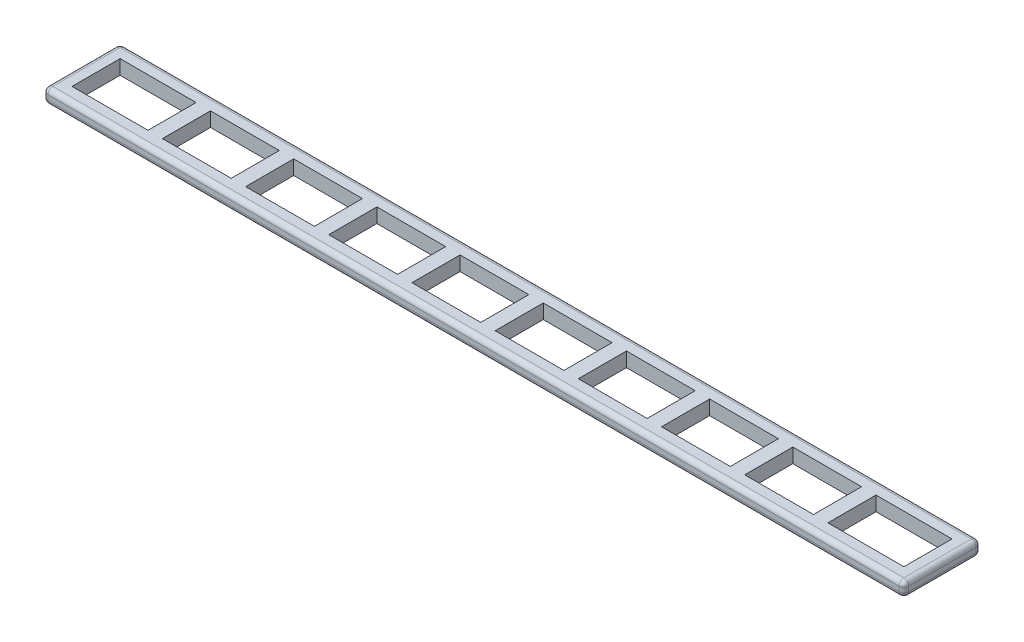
ISO-10303-21;
HEADER;
FILE_DESCRIPTION(('STEP AP214'),'2;1');
FILE_NAME('part.step','',(''),(''),'','','');
FILE_SCHEMA(('AUTOMOTIVE_DESIGN { 1 0 10303 214 1 1 1 1 }'));
ENDSEC;
DATA;
#1=APPLICATION_CONTEXT('core data for automotive mechanical design processes');
#2=APPLICATION_PROTOCOL_DEFINITION('international standard','automotive_design',2000,#1);
#3=PRODUCT_CONTEXT('',#1,'mechanical');
#4=PRODUCT('Part','Part','',(#3));
#5=PRODUCT_RELATED_PRODUCT_CATEGORY('part','',(#4));
#6=PRODUCT_DEFINITION_FORMATION('','',#4);
#7=PRODUCT_DEFINITION_CONTEXT('part definition',#1,'design');
#8=PRODUCT_DEFINITION('design','',#6,#7);
#9=PRODUCT_DEFINITION_SHAPE('','',#8);
#10=(LENGTH_UNIT() NAMED_UNIT(*) SI_UNIT(.MILLI.,.METRE.));
#11=(NAMED_UNIT(*) PLANE_ANGLE_UNIT() SI_UNIT($,.RADIAN.));
#12=(NAMED_UNIT(*) SI_UNIT($,.STERADIAN.) SOLID_ANGLE_UNIT());
#13=UNCERTAINTY_MEASURE_WITH_UNIT(LENGTH_MEASURE(1.E-05),#10,'distance_accuracy_value','');
#14=(GEOMETRIC_REPRESENTATION_CONTEXT(3) GLOBAL_UNCERTAINTY_ASSIGNED_CONTEXT((#13)) GLOBAL_UNIT_ASSIGNED_CONTEXT((#10,
#11,#12)) REPRESENTATION_CONTEXT('',''));
#15=CARTESIAN_POINT('',(0.,0.,0.));
#16=DIRECTION('',(0.,0.,1.));
#17=DIRECTION('',(1.,0.,0.));
#18=AXIS2_PLACEMENT_3D('',#15,#16,#17);
#19=CARTESIAN_POINT('',(4.7625,0.,-4.7625));
#20=DIRECTION('',(0.,0.,1.));
#21=DIRECTION('',(1.,0.,0.));
#22=AXIS2_PLACEMENT_3D('',#19,#20,#21);
#23=PLANE('',#22);
#24=DIRECTION('',(0.,-1.,0.));
#25=VECTOR('',#24,1.);
#26=CARTESIAN_POINT('',(249.555,4.7625,-4.7625));
#27=LINE('',#26,#25);
#28=CARTESIAN_POINT('',(249.555,4.7625,-4.7625));
#29=VERTEX_POINT('',#28);
#30=CARTESIAN_POINT('',(249.555,0.,-4.7625));
#31=VERTEX_POINT('',#30);
#32=EDGE_CURVE('E386',#29,#31,#27,.T.);
#33=ORIENTED_EDGE('',*,*,#32,.T.);
#34=DIRECTION('',(1.,0.,0.));
#35=VECTOR('',#34,1.);
#36=CARTESIAN_POINT('',(4.7625,0.,-4.7625));
#37=LINE('',#36,#35);
#38=CARTESIAN_POINT('',(226.85375,0.,-4.7625));
#39=VERTEX_POINT('',#38);
#40=EDGE_CURVE('E391',#39,#31,#37,.T.);
#41=ORIENTED_EDGE('',*,*,#40,.F.);
#42=DIRECTION('',(0.,1.,0.));
#43=VECTOR('',#42,1.);
#44=CARTESIAN_POINT('',(226.85375,4.7625,-4.7625));
#45=LINE('',#44,#43);
#46=CARTESIAN_POINT('',(226.85375,4.7625,-4.7625));
#47=VERTEX_POINT('',#46);
#48=EDGE_CURVE('E452',#39,#47,#45,.T.);
#49=ORIENTED_EDGE('',*,*,#48,.T.);
#50=DIRECTION('',(-1.,0.,0.));
#51=VECTOR('',#50,1.);
#52=CARTESIAN_POINT('',(284.1625,4.7625,-4.7625));
#53=LINE('',#52,#51);
#54=EDGE_CURVE('E716',#29,#47,#53,.T.);
#55=ORIENTED_EDGE('',*,*,#54,.F.);
#56=EDGE_LOOP('',(#33,#41,#49,#55));
#57=FACE_BOUND('',#56,.T.);
#58=ADVANCED_FACE('F33',(#57),#23,.F.);
#59=DIRECTION('',(0.,1.,0.));
#60=VECTOR('',#59,1.);
#61=CARTESIAN_POINT('',(254.3175,4.7625,-4.7625));
#62=LINE('',#61,#60);
#63=CARTESIAN_POINT('',(254.3175,0.,-4.7625));
#64=VERTEX_POINT('',#63);
#65=CARTESIAN_POINT('',(254.3175,4.7625,-4.7625));
#66=VERTEX_POINT('',#65);
#67=EDGE_CURVE('E379',#64,#66,#62,.T.);
#68=ORIENTED_EDGE('',*,*,#67,.T.);
#69=CARTESIAN_POINT('',(279.4,4.7625,-4.7625));
#70=VERTEX_POINT('',#69);
#71=EDGE_CURVE('E713',#70,#66,#53,.T.);
#72=ORIENTED_EDGE('',*,*,#71,.F.);
#73=DIRECTION('',(0.,1.,0.));
#74=VECTOR('',#73,1.);
#75=CARTESIAN_POINT('',(279.4,0.,-4.7625));
#76=LINE('',#75,#74);
#77=CARTESIAN_POINT('',(279.4,0.,-4.7625));
#78=VERTEX_POINT('',#77);
#79=EDGE_CURVE('E389',#78,#70,#76,.T.);
#80=ORIENTED_EDGE('',*,*,#79,.F.);
#81=EDGE_CURVE('E370',#64,#78,#37,.T.);
#82=ORIENTED_EDGE('',*,*,#81,.F.);
#83=EDGE_LOOP('',(#68,#72,#80,#82));
#84=FACE_BOUND('',#83,.T.);
#85=ADVANCED_FACE('F388',(#84),#23,.F.);
#86=CARTESIAN_POINT('',(279.4,0.,-20.6375));
#87=DIRECTION('',(0.,0.,-1.));
#88=DIRECTION('',(-1.,0.,0.));
#89=AXIS2_PLACEMENT_3D('',#86,#87,#88);
#90=PLANE('',#89);
#91=DIRECTION('',(0.,-1.,0.));
#92=VECTOR('',#91,1.);
#93=CARTESIAN_POINT('',(249.555,4.7625,-20.6375));
#94=LINE('',#93,#92);
#95=CARTESIAN_POINT('',(249.555,4.7625,-20.6375));
#96=VERTEX_POINT('',#95);
#97=CARTESIAN_POINT('',(249.555,0.,-20.6375));
#98=VERTEX_POINT('',#97);
#99=EDGE_CURVE('E834',#96,#98,#94,.T.);
#100=ORIENTED_EDGE('',*,*,#99,.F.);
#101=DIRECTION('',(1.,0.,0.));
#102=VECTOR('',#101,1.);
#103=CARTESIAN_POINT('',(284.1625,4.7625,-20.6375));
#104=LINE('',#103,#102);
#105=CARTESIAN_POINT('',(226.85375,4.7625,-20.6375));
#106=VERTEX_POINT('',#105);
#107=EDGE_CURVE('E632',#106,#96,#104,.T.);
#108=ORIENTED_EDGE('',*,*,#107,.F.);
#109=DIRECTION('',(0.,1.,0.));
#110=VECTOR('',#109,1.);
#111=CARTESIAN_POINT('',(226.85375,4.7625,-20.6375));
#112=LINE('',#111,#110);
#113=CARTESIAN_POINT('',(226.85375,0.,-20.6375));
#114=VERTEX_POINT('',#113);
#115=EDGE_CURVE('E458',#114,#106,#112,.T.);
#116=ORIENTED_EDGE('',*,*,#115,.F.);
#117=DIRECTION('',(-1.,0.,0.));
#118=VECTOR('',#117,1.);
#119=CARTESIAN_POINT('',(279.4,0.,-20.6375));
#120=LINE('',#119,#118);
#121=EDGE_CURVE('E651',#98,#114,#120,.T.);
#122=ORIENTED_EDGE('',*,*,#121,.F.);
#123=EDGE_LOOP('',(#100,#108,#116,#122));
#124=FACE_BOUND('',#123,.T.);
#125=ADVANCED_FACE('F848',(#124),#90,.F.);
#126=DIRECTION('',(0.,1.,0.));
#127=VECTOR('',#126,1.);
#128=CARTESIAN_POINT('',(254.3175,4.7625,-20.6375));
#129=LINE('',#128,#127);
#130=CARTESIAN_POINT('',(254.3175,0.,-20.6375));
#131=VERTEX_POINT('',#130);
#132=CARTESIAN_POINT('',(254.3175,4.7625,-20.6375));
#133=VERTEX_POINT('',#132);
#134=EDGE_CURVE('E375',#131,#133,#129,.T.);
#135=ORIENTED_EDGE('',*,*,#134,.F.);
#136=CARTESIAN_POINT('',(279.4,0.,-20.6375));
#137=VERTEX_POINT('',#136);
#138=EDGE_CURVE('E372',#137,#131,#120,.T.);
#139=ORIENTED_EDGE('',*,*,#138,.F.);
#140=DIRECTION('',(0.,1.,0.));
#141=VECTOR('',#140,1.);
#142=CARTESIAN_POINT('',(279.4,0.,-20.6375));
#143=LINE('',#142,#141);
#144=CARTESIAN_POINT('',(279.4,4.7625,-20.6375));
#145=VERTEX_POINT('',#144);
#146=EDGE_CURVE('E645',#137,#145,#143,.T.);
#147=ORIENTED_EDGE('',*,*,#146,.T.);
#148=EDGE_CURVE('E626',#133,#145,#104,.T.);
#149=ORIENTED_EDGE('',*,*,#148,.F.);
#150=EDGE_LOOP('',(#135,#139,#147,#149));
#151=FACE_BOUND('',#150,.T.);
#152=ADVANCED_FACE('F928',(#151),#90,.F.);
#153=DIRECTION('',(0.,-1.,0.));
#154=VECTOR('',#153,1.);
#155=CARTESIAN_POINT('',(222.09125,4.7625,-4.7625));
#156=LINE('',#155,#154);
#157=CARTESIAN_POINT('',(222.09125,4.7625,-4.7625));
#158=VERTEX_POINT('',#157);
#159=CARTESIAN_POINT('',(222.09125,0.,-4.7625));
#160=VERTEX_POINT('',#159);
#161=EDGE_CURVE('E448',#158,#160,#156,.T.);
#162=ORIENTED_EDGE('',*,*,#161,.T.);
#163=CARTESIAN_POINT('',(199.39,0.,-4.7625));
#164=VERTEX_POINT('',#163);
#165=EDGE_CURVE('E396',#164,#160,#37,.T.);
#166=ORIENTED_EDGE('',*,*,#165,.F.);
#167=DIRECTION('',(0.,1.,0.));
#168=VECTOR('',#167,1.);
#169=CARTESIAN_POINT('',(199.39,4.7625,-4.7625));
#170=LINE('',#169,#168);
#171=CARTESIAN_POINT('',(199.39,4.7625,-4.7625));
#172=VERTEX_POINT('',#171);
#173=EDGE_CURVE('E446',#164,#172,#170,.T.);
#174=ORIENTED_EDGE('',*,*,#173,.T.);
#175=EDGE_CURVE('E449',#158,#172,#53,.T.);
#176=ORIENTED_EDGE('',*,*,#175,.F.);
#177=EDGE_LOOP('',(#162,#166,#174,#176));
#178=FACE_BOUND('',#177,.T.);
#179=ADVANCED_FACE('F444',(#178),#23,.F.);
#180=DIRECTION('',(0.,-1.,0.));
#181=VECTOR('',#180,1.);
#182=CARTESIAN_POINT('',(222.09125,4.7625,-20.6375));
#183=LINE('',#182,#181);
#184=CARTESIAN_POINT('',(222.09125,4.7625,-20.6375));
#185=VERTEX_POINT('',#184);
#186=CARTESIAN_POINT('',(222.09125,0.,-20.6375));
#187=VERTEX_POINT('',#186);
#188=EDGE_CURVE('E461',#185,#187,#183,.T.);
#189=ORIENTED_EDGE('',*,*,#188,.F.);
#190=CARTESIAN_POINT('',(199.39,4.7625,-20.6375));
#191=VERTEX_POINT('',#190);
#192=EDGE_CURVE('E638',#191,#185,#104,.T.);
#193=ORIENTED_EDGE('',*,*,#192,.F.);
#194=DIRECTION('',(0.,1.,0.));
#195=VECTOR('',#194,1.);
#196=CARTESIAN_POINT('',(199.39,4.7625,-20.6375));
#197=LINE('',#196,#195);
#198=CARTESIAN_POINT('',(199.39,0.,-20.6375));
#199=VERTEX_POINT('',#198);
#200=EDGE_CURVE('E473',#199,#191,#197,.T.);
#201=ORIENTED_EDGE('',*,*,#200,.F.);
#202=EDGE_CURVE('E652',#187,#199,#120,.T.);
#203=ORIENTED_EDGE('',*,*,#202,.F.);
#204=EDGE_LOOP('',(#189,#193,#201,#203));
#205=FACE_BOUND('',#204,.T.);
#206=ADVANCED_FACE('F673',(#205),#90,.F.);
#207=DIRECTION('',(0.,-1.,0.));
#208=VECTOR('',#207,1.);
#209=CARTESIAN_POINT('',(194.6275,4.7625,-4.7625));
#210=LINE('',#209,#208);
#211=CARTESIAN_POINT('',(194.6275,4.7625,-4.7625));
#212=VERTEX_POINT('',#211);
#213=CARTESIAN_POINT('',(194.6275,0.,-4.7625));
#214=VERTEX_POINT('',#213);
#215=EDGE_CURVE('E479',#212,#214,#210,.T.);
#216=ORIENTED_EDGE('',*,*,#215,.T.);
#217=CARTESIAN_POINT('',(171.92625,0.,-4.7625));
#218=VERTEX_POINT('',#217);
#219=EDGE_CURVE('E427',#218,#214,#37,.T.);
#220=ORIENTED_EDGE('',*,*,#219,.F.);
#221=DIRECTION('',(0.,1.,0.));
#222=VECTOR('',#221,1.);
#223=CARTESIAN_POINT('',(171.92625,4.7625,-4.7625));
#224=LINE('',#223,#222);
#225=CARTESIAN_POINT('',(171.92625,4.7625,-4.7625));
#226=VERTEX_POINT('',#225);
#227=EDGE_CURVE('E489',#218,#226,#224,.T.);
#228=ORIENTED_EDGE('',*,*,#227,.T.);
#229=EDGE_CURVE('E1560',#212,#226,#53,.T.);
#230=ORIENTED_EDGE('',*,*,#229,.F.);
#231=EDGE_LOOP('',(#216,#220,#228,#230));
#232=FACE_BOUND('',#231,.T.);
#233=ADVANCED_FACE('F918',(#232),#23,.F.);
#234=DIRECTION('',(0.,-1.,0.));
#235=VECTOR('',#234,1.);
#236=CARTESIAN_POINT('',(194.6275,4.7625,-20.6375));
#237=LINE('',#236,#235);
#238=CARTESIAN_POINT('',(194.6275,4.7625,-20.6375));
#239=VERTEX_POINT('',#238);
#240=CARTESIAN_POINT('',(194.6275,0.,-20.6375));
#241=VERTEX_POINT('',#240);
#242=EDGE_CURVE('E475',#239,#241,#237,.T.);
#243=ORIENTED_EDGE('',*,*,#242,.F.);
#244=CARTESIAN_POINT('',(171.92625,4.7625,-20.6375));
#245=VERTEX_POINT('',#244);
#246=EDGE_CURVE('E676',#245,#239,#104,.T.);
#247=ORIENTED_EDGE('',*,*,#246,.F.);
#248=DIRECTION('',(0.,1.,0.));
#249=VECTOR('',#248,1.);
#250=CARTESIAN_POINT('',(171.92625,4.7625,-20.6375));
#251=LINE('',#250,#249);
#252=CARTESIAN_POINT('',(171.92625,0.,-20.6375));
#253=VERTEX_POINT('',#252);
#254=EDGE_CURVE('E487',#253,#245,#251,.T.);
#255=ORIENTED_EDGE('',*,*,#254,.F.);
#256=EDGE_CURVE('E662',#241,#253,#120,.T.);
#257=ORIENTED_EDGE('',*,*,#256,.F.);
#258=EDGE_LOOP('',(#243,#247,#255,#257));
#259=FACE_BOUND('',#258,.T.);
#260=ADVANCED_FACE('F915',(#259),#90,.F.);
#261=DIRECTION('',(0.,-1.,0.));
#262=VECTOR('',#261,1.);
#263=CARTESIAN_POINT('',(167.16375,4.7625,-4.7625));
#264=LINE('',#263,#262);
#265=CARTESIAN_POINT('',(167.16375,4.7625,-4.7625));
#266=VERTEX_POINT('',#265);
#267=CARTESIAN_POINT('',(167.16375,0.,-4.7625));
#268=VERTEX_POINT('',#267);
#269=EDGE_CURVE('E496',#266,#268,#264,.T.);
#270=ORIENTED_EDGE('',*,*,#269,.T.);
#271=CARTESIAN_POINT('',(144.4625,0.,-4.7625));
#272=VERTEX_POINT('',#271);
#273=EDGE_CURVE('E423',#272,#268,#37,.T.);
#274=ORIENTED_EDGE('',*,*,#273,.F.);
#275=DIRECTION('',(0.,1.,0.));
#276=VECTOR('',#275,1.);
#277=CARTESIAN_POINT('',(144.4625,4.7625,-4.7625));
#278=LINE('',#277,#276);
#279=CARTESIAN_POINT('',(144.4625,4.7625,-4.7625));
#280=VERTEX_POINT('',#279);
#281=EDGE_CURVE('E510',#272,#280,#278,.T.);
#282=ORIENTED_EDGE('',*,*,#281,.T.);
#283=EDGE_CURVE('E1563',#266,#280,#53,.T.);
#284=ORIENTED_EDGE('',*,*,#283,.F.);
#285=EDGE_LOOP('',(#270,#274,#282,#284));
#286=FACE_BOUND('',#285,.T.);
#287=ADVANCED_FACE('F910',(#286),#23,.F.);
#288=DIRECTION('',(0.,-1.,0.));
#289=VECTOR('',#288,1.);
#290=CARTESIAN_POINT('',(167.16375,4.7625,-20.6375));
#291=LINE('',#290,#289);
#292=CARTESIAN_POINT('',(167.16375,4.7625,-20.6375));
#293=VERTEX_POINT('',#292);
#294=CARTESIAN_POINT('',(167.16375,0.,-20.6375));
#295=VERTEX_POINT('',#294);
#296=EDGE_CURVE('E491',#293,#295,#291,.T.);
#297=ORIENTED_EDGE('',*,*,#296,.F.);
#298=CARTESIAN_POINT('',(144.4625,4.7625,-20.6375));
#299=VERTEX_POINT('',#298);
#300=EDGE_CURVE('E678',#299,#293,#104,.T.);
#301=ORIENTED_EDGE('',*,*,#300,.F.);
#302=DIRECTION('',(0.,1.,0.));
#303=VECTOR('',#302,1.);
#304=CARTESIAN_POINT('',(144.4625,4.7625,-20.6375));
#305=LINE('',#304,#303);
#306=CARTESIAN_POINT('',(144.4625,0.,-20.6375));
#307=VERTEX_POINT('',#306);
#308=EDGE_CURVE('E508',#307,#299,#305,.T.);
#309=ORIENTED_EDGE('',*,*,#308,.F.);
#310=EDGE_CURVE('E660',#295,#307,#120,.T.);
#311=ORIENTED_EDGE('',*,*,#310,.F.);
#312=EDGE_LOOP('',(#297,#301,#309,#311));
#313=FACE_BOUND('',#312,.T.);
#314=ADVANCED_FACE('F907',(#313),#90,.F.);
#315=DIRECTION('',(0.,-1.,0.));
#316=VECTOR('',#315,1.);
#317=CARTESIAN_POINT('',(139.7,4.7625,-4.7625));
#318=LINE('',#317,#316);
#319=CARTESIAN_POINT('',(139.7,4.7625,-4.7625));
#320=VERTEX_POINT('',#319);
#321=CARTESIAN_POINT('',(139.7,0.,-4.7625));
#322=VERTEX_POINT('',#321);
#323=EDGE_CURVE('E517',#320,#322,#318,.T.);
#324=ORIENTED_EDGE('',*,*,#323,.T.);
#325=CARTESIAN_POINT('',(116.99875,0.,-4.7625));
#326=VERTEX_POINT('',#325);
#327=EDGE_CURVE('E419',#326,#322,#37,.T.);
#328=ORIENTED_EDGE('',*,*,#327,.F.);
#329=DIRECTION('',(0.,1.,0.));
#330=VECTOR('',#329,1.);
#331=CARTESIAN_POINT('',(116.99875,4.7625,-4.7625));
#332=LINE('',#331,#330);
#333=CARTESIAN_POINT('',(116.99875,4.7625,-4.7625));
#334=VERTEX_POINT('',#333);
#335=EDGE_CURVE('E531',#326,#334,#332,.T.);
#336=ORIENTED_EDGE('',*,*,#335,.T.);
#337=EDGE_CURVE('E712',#320,#334,#53,.T.);
#338=ORIENTED_EDGE('',*,*,#337,.F.);
#339=EDGE_LOOP('',(#324,#328,#336,#338));
#340=FACE_BOUND('',#339,.T.);
#341=ADVANCED_FACE('F902',(#340),#23,.F.);
#342=DIRECTION('',(0.,-1.,0.));
#343=VECTOR('',#342,1.);
#344=CARTESIAN_POINT('',(139.7,4.7625,-20.6375));
#345=LINE('',#344,#343);
#346=CARTESIAN_POINT('',(139.7,4.7625,-20.6375));
#347=VERTEX_POINT('',#346);
#348=CARTESIAN_POINT('',(139.7,0.,-20.6375));
#349=VERTEX_POINT('',#348);
#350=EDGE_CURVE('E512',#347,#349,#345,.T.);
#351=ORIENTED_EDGE('',*,*,#350,.F.);
#352=CARTESIAN_POINT('',(116.99875,4.7625,-20.6375));
#353=VERTEX_POINT('',#352);
#354=EDGE_CURVE('E682',#353,#347,#104,.T.);
#355=ORIENTED_EDGE('',*,*,#354,.F.);
#356=DIRECTION('',(0.,1.,0.));
#357=VECTOR('',#356,1.);
#358=CARTESIAN_POINT('',(116.99875,4.7625,-20.6375));
#359=LINE('',#358,#357);
#360=CARTESIAN_POINT('',(116.99875,0.,-20.6375));
#361=VERTEX_POINT('',#360);
#362=EDGE_CURVE('E529',#361,#353,#359,.T.);
#363=ORIENTED_EDGE('',*,*,#362,.F.);
#364=EDGE_CURVE('E658',#349,#361,#120,.T.);
#365=ORIENTED_EDGE('',*,*,#364,.F.);
#366=EDGE_LOOP('',(#351,#355,#363,#365));
#367=FACE_BOUND('',#366,.T.);
#368=ADVANCED_FACE('F899',(#367),#90,.F.);
#369=DIRECTION('',(0.,-1.,0.));
#370=VECTOR('',#369,1.);
#371=CARTESIAN_POINT('',(112.23625,4.7625,-4.7625));
#372=LINE('',#371,#370);
#373=CARTESIAN_POINT('',(112.23625,4.7625,-4.7625));
#374=VERTEX_POINT('',#373);
#375=CARTESIAN_POINT('',(112.23625,0.,-4.7625));
#376=VERTEX_POINT('',#375);
#377=EDGE_CURVE('E538',#374,#376,#372,.T.);
#378=ORIENTED_EDGE('',*,*,#377,.T.);
#379=CARTESIAN_POINT('',(89.535,0.,-4.7625));
#380=VERTEX_POINT('',#379);
#381=EDGE_CURVE('E415',#380,#376,#37,.T.);
#382=ORIENTED_EDGE('',*,*,#381,.F.);
#383=DIRECTION('',(0.,1.,0.));
#384=VECTOR('',#383,1.);
#385=CARTESIAN_POINT('',(89.535,4.7625,-4.7625));
#386=LINE('',#385,#384);
#387=CARTESIAN_POINT('',(89.535,4.7625,-4.7625));
#388=VERTEX_POINT('',#387);
#389=EDGE_CURVE('E552',#380,#388,#386,.T.);
#390=ORIENTED_EDGE('',*,*,#389,.T.);
#391=EDGE_CURVE('E709',#374,#388,#53,.T.);
#392=ORIENTED_EDGE('',*,*,#391,.F.);
#393=EDGE_LOOP('',(#378,#382,#390,#392));
#394=FACE_BOUND('',#393,.T.);
#395=ADVANCED_FACE('F894',(#394),#23,.F.);
#396=DIRECTION('',(0.,-1.,0.));
#397=VECTOR('',#396,1.);
#398=CARTESIAN_POINT('',(112.23625,4.7625,-20.6375));
#399=LINE('',#398,#397);
#400=CARTESIAN_POINT('',(112.23625,4.7625,-20.6375));
#401=VERTEX_POINT('',#400);
#402=CARTESIAN_POINT('',(112.23625,0.,-20.6375));
#403=VERTEX_POINT('',#402);
#404=EDGE_CURVE('E533',#401,#403,#399,.T.);
#405=ORIENTED_EDGE('',*,*,#404,.F.);
#406=CARTESIAN_POINT('',(89.535,4.7625,-20.6375));
#407=VERTEX_POINT('',#406);
#408=EDGE_CURVE('E686',#407,#401,#104,.T.);
#409=ORIENTED_EDGE('',*,*,#408,.F.);
#410=DIRECTION('',(0.,1.,0.));
#411=VECTOR('',#410,1.);
#412=CARTESIAN_POINT('',(89.535,4.7625,-20.6375));
#413=LINE('',#412,#411);
#414=CARTESIAN_POINT('',(89.535,0.,-20.6375));
#415=VERTEX_POINT('',#414);
#416=EDGE_CURVE('E550',#415,#407,#413,.T.);
#417=ORIENTED_EDGE('',*,*,#416,.F.);
#418=EDGE_CURVE('E656',#403,#415,#120,.T.);
#419=ORIENTED_EDGE('',*,*,#418,.F.);
#420=EDGE_LOOP('',(#405,#409,#417,#419));
#421=FACE_BOUND('',#420,.T.);
#422=ADVANCED_FACE('F892',(#421),#90,.F.);
#423=DIRECTION('',(0.,-1.,0.));
#424=VECTOR('',#423,1.);
#425=CARTESIAN_POINT('',(84.7725,4.7625,-4.7625));
#426=LINE('',#425,#424);
#427=CARTESIAN_POINT('',(84.7725,4.7625,-4.7625));
#428=VERTEX_POINT('',#427);
#429=CARTESIAN_POINT('',(84.7725,0.,-4.7625));
#430=VERTEX_POINT('',#429);
#431=EDGE_CURVE('E559',#428,#430,#426,.T.);
#432=ORIENTED_EDGE('',*,*,#431,.T.);
#433=CARTESIAN_POINT('',(62.07125,0.,-4.7625));
#434=VERTEX_POINT('',#433);
#435=EDGE_CURVE('E410',#434,#430,#37,.T.);
#436=ORIENTED_EDGE('',*,*,#435,.F.);
#437=DIRECTION('',(0.,1.,0.));
#438=VECTOR('',#437,1.);
#439=CARTESIAN_POINT('',(62.07125,4.7625,-4.7625));
#440=LINE('',#439,#438);
#441=CARTESIAN_POINT('',(62.07125,4.7625,-4.7625));
#442=VERTEX_POINT('',#441);
#443=EDGE_CURVE('E573',#434,#442,#440,.T.);
#444=ORIENTED_EDGE('',*,*,#443,.T.);
#445=EDGE_CURVE('E706',#428,#442,#53,.T.);
#446=ORIENTED_EDGE('',*,*,#445,.F.);
#447=EDGE_LOOP('',(#432,#436,#444,#446));
#448=FACE_BOUND('',#447,.T.);
#449=ADVANCED_FACE('F707',(#448),#23,.F.);
#450=DIRECTION('',(0.,-1.,0.));
#451=VECTOR('',#450,1.);
#452=CARTESIAN_POINT('',(84.7725,4.7625,-20.6375));
#453=LINE('',#452,#451);
#454=CARTESIAN_POINT('',(84.7725,4.7625,-20.6375));
#455=VERTEX_POINT('',#454);
#456=CARTESIAN_POINT('',(84.7725,0.,-20.6375));
#457=VERTEX_POINT('',#456);
#458=EDGE_CURVE('E554',#455,#457,#453,.T.);
#459=ORIENTED_EDGE('',*,*,#458,.F.);
#460=CARTESIAN_POINT('',(62.07125,4.7625,-20.6375));
#461=VERTEX_POINT('',#460);
#462=EDGE_CURVE('E630',#461,#455,#104,.T.);
#463=ORIENTED_EDGE('',*,*,#462,.F.);
#464=DIRECTION('',(0.,1.,0.));
#465=VECTOR('',#464,1.);
#466=CARTESIAN_POINT('',(62.07125,4.7625,-20.6375));
#467=LINE('',#466,#465);
#468=CARTESIAN_POINT('',(62.07125,0.,-20.6375));
#469=VERTEX_POINT('',#468);
#470=EDGE_CURVE('E571',#469,#461,#467,.T.);
#471=ORIENTED_EDGE('',*,*,#470,.F.);
#472=EDGE_CURVE('E654',#457,#469,#120,.T.);
#473=ORIENTED_EDGE('',*,*,#472,.F.);
#474=EDGE_LOOP('',(#459,#463,#471,#473));
#475=FACE_BOUND('',#474,.T.);
#476=ADVANCED_FACE('F701',(#475),#90,.F.);
#477=DIRECTION('',(0.,-1.,0.));
#478=VECTOR('',#477,1.);
#479=CARTESIAN_POINT('',(57.30875,4.7625,-4.7625));
#480=LINE('',#479,#478);
#481=CARTESIAN_POINT('',(57.30875,4.7625,-4.7625));
#482=VERTEX_POINT('',#481);
#483=CARTESIAN_POINT('',(57.30875,0.,-4.7625));
#484=VERTEX_POINT('',#483);
#485=EDGE_CURVE('E580',#482,#484,#480,.T.);
#486=ORIENTED_EDGE('',*,*,#485,.T.);
#487=CARTESIAN_POINT('',(34.6075,0.,-4.7625));
#488=VERTEX_POINT('',#487);
#489=EDGE_CURVE('E404',#488,#484,#37,.T.);
#490=ORIENTED_EDGE('',*,*,#489,.F.);
#491=DIRECTION('',(0.,1.,0.));
#492=VECTOR('',#491,1.);
#493=CARTESIAN_POINT('',(34.6075,4.7625,-4.7625));
#494=LINE('',#493,#492);
#495=CARTESIAN_POINT('',(34.6075,4.7625,-4.7625));
#496=VERTEX_POINT('',#495);
#497=EDGE_CURVE('E392',#488,#496,#494,.T.);
#498=ORIENTED_EDGE('',*,*,#497,.T.);
#499=EDGE_CURVE('E710',#482,#496,#53,.T.);
#500=ORIENTED_EDGE('',*,*,#499,.F.);
#501=EDGE_LOOP('',(#486,#490,#498,#500));
#502=FACE_BOUND('',#501,.T.);
#503=ADVANCED_FACE('F879',(#502),#23,.F.);
#504=DIRECTION('',(0.,-1.,0.));
#505=VECTOR('',#504,1.);
#506=CARTESIAN_POINT('',(57.30875,4.7625,-20.6375));
#507=LINE('',#506,#505);
#508=CARTESIAN_POINT('',(57.30875,4.7625,-20.6375));
#509=VERTEX_POINT('',#508);
#510=CARTESIAN_POINT('',(57.30875,0.,-20.6375));
#511=VERTEX_POINT('',#510);
#512=EDGE_CURVE('E575',#509,#511,#507,.T.);
#513=ORIENTED_EDGE('',*,*,#512,.F.);
#514=CARTESIAN_POINT('',(34.6075,4.7625,-20.6375));
#515=VERTEX_POINT('',#514);
#516=EDGE_CURVE('E624',#515,#509,#104,.T.);
#517=ORIENTED_EDGE('',*,*,#516,.F.);
#518=DIRECTION('',(0.,1.,0.));
#519=VECTOR('',#518,1.);
#520=CARTESIAN_POINT('',(34.6075,4.7625,-20.6375));
#521=LINE('',#520,#519);
#522=CARTESIAN_POINT('',(34.6075,0.,-20.6375));
#523=VERTEX_POINT('',#522);
#524=EDGE_CURVE('E592',#523,#515,#521,.T.);
#525=ORIENTED_EDGE('',*,*,#524,.F.);
#526=EDGE_CURVE('E653',#511,#523,#120,.T.);
#527=ORIENTED_EDGE('',*,*,#526,.F.);
#528=EDGE_LOOP('',(#513,#517,#525,#527));
#529=FACE_BOUND('',#528,.T.);
#530=ADVANCED_FACE('F877',(#529),#90,.F.);
#531=DIRECTION('',(0.,-1.,0.));
#532=VECTOR('',#531,1.);
#533=CARTESIAN_POINT('',(29.845,4.7625,-4.7625));
#534=LINE('',#533,#532);
#535=CARTESIAN_POINT('',(29.845,4.7625,-4.7625));
#536=VERTEX_POINT('',#535);
#537=CARTESIAN_POINT('',(29.845,0.,-4.7625));
#538=VERTEX_POINT('',#537);
#539=EDGE_CURVE('E398',#536,#538,#534,.T.);
#540=ORIENTED_EDGE('',*,*,#539,.T.);
#541=CARTESIAN_POINT('',(4.7625,0.,-4.7625));
#542=VERTEX_POINT('',#541);
#543=EDGE_CURVE('E394',#542,#538,#37,.T.);
#544=ORIENTED_EDGE('',*,*,#543,.F.);
#545=DIRECTION('',(0.,1.,0.));
#546=VECTOR('',#545,1.);
#547=CARTESIAN_POINT('',(4.7625,0.,-4.7625));
#548=LINE('',#547,#546);
#549=CARTESIAN_POINT('',(4.7625,4.7625,-4.7625));
#550=VERTEX_POINT('',#549);
#551=EDGE_CURVE('E639',#542,#550,#548,.T.);
#552=ORIENTED_EDGE('',*,*,#551,.T.);
#553=EDGE_CURVE('E627',#536,#550,#53,.T.);
#554=ORIENTED_EDGE('',*,*,#553,.F.);
#555=EDGE_LOOP('',(#540,#544,#552,#554));
#556=FACE_BOUND('',#555,.T.);
#557=ADVANCED_FACE('F870',(#556),#23,.F.);
#558=DIRECTION('',(0.,-1.,0.));
#559=VECTOR('',#558,1.);
#560=CARTESIAN_POINT('',(29.845,4.7625,-20.6375));
#561=LINE('',#560,#559);
#562=CARTESIAN_POINT('',(29.845,4.7625,-20.6375));
#563=VERTEX_POINT('',#562);
#564=CARTESIAN_POINT('',(29.845,0.,-20.6375));
#565=VERTEX_POINT('',#564);
#566=EDGE_CURVE('E596',#563,#565,#561,.T.);
#567=ORIENTED_EDGE('',*,*,#566,.F.);
#568=CARTESIAN_POINT('',(4.7625,4.7625,-20.6375));
#569=VERTEX_POINT('',#568);
#570=EDGE_CURVE('E617',#569,#563,#104,.T.);
#571=ORIENTED_EDGE('',*,*,#570,.F.);
#572=DIRECTION('',(0.,1.,0.));
#573=VECTOR('',#572,1.);
#574=CARTESIAN_POINT('',(4.7625,0.,-20.6375));
#575=LINE('',#574,#573);
#576=CARTESIAN_POINT('',(4.7625,0.,-20.6375));
#577=VERTEX_POINT('',#576);
#578=EDGE_CURVE('E641',#577,#569,#575,.T.);
#579=ORIENTED_EDGE('',*,*,#578,.F.);
#580=EDGE_CURVE('E408',#565,#577,#120,.T.);
#581=ORIENTED_EDGE('',*,*,#580,.F.);
#582=EDGE_LOOP('',(#567,#571,#579,#581));
#583=FACE_BOUND('',#582,.T.);
#584=ADVANCED_FACE('F615',(#583),#90,.F.);
#585=CARTESIAN_POINT('',(284.1625,0.,0.));
#586=DIRECTION('',(0.,0.,-1.));
#587=DIRECTION('',(-1.,0.,0.));
#588=AXIS2_PLACEMENT_3D('',#585,#586,#587);
#589=PLANE('',#588);
#590=DIRECTION('',(0.,-1.,0.));
#591=VECTOR('',#590,1.);
#592=CARTESIAN_POINT('',(1.58750000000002,0.,0.));
#593=LINE('',#592,#591);
#594=CARTESIAN_POINT('',(1.58750000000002,3.175,0.));
#595=VERTEX_POINT('',#594);
#596=CARTESIAN_POINT('',(1.58750000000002,1.5875,0.));
#597=VERTEX_POINT('',#596);
#598=EDGE_CURVE('E720',#595,#597,#593,.T.);
#599=ORIENTED_EDGE('',*,*,#598,.T.);
#600=DIRECTION('',(-1.,0.,0.));
#601=VECTOR('',#600,1.);
#602=CARTESIAN_POINT('',(284.1625,1.5875,0.));
#603=LINE('',#602,#601);
#604=CARTESIAN_POINT('',(282.575,1.5875,0.));
#605=VERTEX_POINT('',#604);
#606=EDGE_CURVE('E723',#597,#605,#603,.F.);
#607=ORIENTED_EDGE('',*,*,#606,.T.);
#608=DIRECTION('',(0.,-1.,0.));
#609=VECTOR('',#608,1.);
#610=CARTESIAN_POINT('',(282.575,0.,0.));
#611=LINE('',#610,#609);
#612=CARTESIAN_POINT('',(282.575,3.175,0.));
#613=VERTEX_POINT('',#612);
#614=EDGE_CURVE('E718',#605,#613,#611,.F.);
#615=ORIENTED_EDGE('',*,*,#614,.T.);
#616=DIRECTION('',(-1.,0.,0.));
#617=VECTOR('',#616,1.);
#618=CARTESIAN_POINT('',(284.1625,3.175,0.));
#619=LINE('',#618,#617);
#620=EDGE_CURVE('E715',#613,#595,#619,.T.);
#621=ORIENTED_EDGE('',*,*,#620,.T.);
#622=EDGE_LOOP('',(#599,#607,#615,#621));
#623=FACE_BOUND('',#622,.T.);
#624=ADVANCED_FACE('F884',(#623),#589,.F.);
#625=CARTESIAN_POINT('',(284.1625,0.,0.));
#626=DIRECTION('',(0.,1.,0.));
#627=DIRECTION('',(0.,0.,1.));
#628=AXIS2_PLACEMENT_3D('',#625,#626,#627);
#629=PLANE('',#628);
#630=DIRECTION('',(-1.,0.,0.));
#631=VECTOR('',#630,1.);
#632=CARTESIAN_POINT('',(284.1625,0.,-1.5875));
#633=LINE('',#632,#631);
#634=CARTESIAN_POINT('',(282.575,0.,-1.5875));
#635=VERTEX_POINT('',#634);
#636=CARTESIAN_POINT('',(1.58750000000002,0.,-1.5875));
#637=VERTEX_POINT('',#636);
#638=EDGE_CURVE('E743',#635,#637,#633,.T.);
#639=ORIENTED_EDGE('',*,*,#638,.T.);
#640=DIRECTION('',(0.,0.,-1.));
#641=VECTOR('',#640,1.);
#642=CARTESIAN_POINT('',(1.58750000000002,0.,-25.4));
#643=LINE('',#642,#641);
#644=CARTESIAN_POINT('',(1.58750000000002,0.,-23.8125));
#645=VERTEX_POINT('',#644);
#646=EDGE_CURVE('E749',#637,#645,#643,.T.);
#647=ORIENTED_EDGE('',*,*,#646,.T.);
#648=DIRECTION('',(-1.,0.,0.));
#649=VECTOR('',#648,1.);
#650=CARTESIAN_POINT('',(284.1625,0.,-23.8125));
#651=LINE('',#650,#649);
#652=CARTESIAN_POINT('',(282.575,0.,-23.8125));
#653=VERTEX_POINT('',#652);
#654=EDGE_CURVE('E747',#645,#653,#651,.F.);
#655=ORIENTED_EDGE('',*,*,#654,.T.);
#656=DIRECTION('',(0.,0.,-1.));
#657=VECTOR('',#656,1.);
#658=CARTESIAN_POINT('',(282.575,0.,0.));
#659=LINE('',#658,#657);
#660=EDGE_CURVE('E745',#653,#635,#659,.F.);
#661=ORIENTED_EDGE('',*,*,#660,.T.);
#662=EDGE_LOOP('',(#639,#647,#655,#661));
#663=FACE_BOUND('',#662,.T.);
#664=ORIENTED_EDGE('',*,*,#138,.T.);
#665=DIRECTION('',(0.,0.,-1.));
#666=VECTOR('',#665,1.);
#667=CARTESIAN_POINT('',(254.3175,0.,1.97269209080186));
#668=LINE('',#667,#666);
#669=EDGE_CURVE('E364',#64,#131,#668,.T.);
#670=ORIENTED_EDGE('',*,*,#669,.F.);
#671=ORIENTED_EDGE('',*,*,#81,.T.);
#672=DIRECTION('',(0.,0.,-1.));
#673=VECTOR('',#672,1.);
#674=CARTESIAN_POINT('',(279.4,0.,-4.7625));
#675=LINE('',#674,#673);
#676=EDGE_CURVE('E403',#78,#137,#675,.T.);
#677=ORIENTED_EDGE('',*,*,#676,.T.);
#678=EDGE_LOOP('',(#664,#670,#671,#677));
#679=FACE_BOUND('',#678,.T.);
#680=DIRECTION('',(0.,0.,-1.));
#681=VECTOR('',#680,1.);
#682=CARTESIAN_POINT('',(249.555,0.,1.97269209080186));
#683=LINE('',#682,#681);
#684=EDGE_CURVE('E376',#31,#98,#683,.T.);
#685=ORIENTED_EDGE('',*,*,#684,.T.);
#686=ORIENTED_EDGE('',*,*,#121,.T.);
#687=DIRECTION('',(0.,0.,-1.));
#688=VECTOR('',#687,1.);
#689=CARTESIAN_POINT('',(226.85375,0.,1.97269209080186));
#690=LINE('',#689,#688);
#691=EDGE_CURVE('E468',#39,#114,#690,.T.);
#692=ORIENTED_EDGE('',*,*,#691,.F.);
#693=ORIENTED_EDGE('',*,*,#40,.T.);
#694=EDGE_LOOP('',(#685,#686,#692,#693));
#695=FACE_BOUND('',#694,.T.);
#696=DIRECTION('',(0.,0.,-1.));
#697=VECTOR('',#696,1.);
#698=CARTESIAN_POINT('',(222.09125,0.,1.97269209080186));
#699=LINE('',#698,#697);
#700=EDGE_CURVE('E436',#160,#187,#699,.T.);
#701=ORIENTED_EDGE('',*,*,#700,.T.);
#702=ORIENTED_EDGE('',*,*,#202,.T.);
#703=DIRECTION('',(0.,0.,-1.));
#704=VECTOR('',#703,1.);
#705=CARTESIAN_POINT('',(199.39,0.,1.97269209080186));
#706=LINE('',#705,#704);
#707=EDGE_CURVE('E439',#164,#199,#706,.T.);
#708=ORIENTED_EDGE('',*,*,#707,.F.);
#709=ORIENTED_EDGE('',*,*,#165,.T.);
#710=EDGE_LOOP('',(#701,#702,#708,#709));
#711=FACE_BOUND('',#710,.T.);
#712=DIRECTION('',(0.,0.,-1.));
#713=VECTOR('',#712,1.);
#714=CARTESIAN_POINT('',(194.6275,0.,1.97269209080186));
#715=LINE('',#714,#713);
#716=EDGE_CURVE('E478',#214,#241,#715,.T.);
#717=ORIENTED_EDGE('',*,*,#716,.T.);
#718=ORIENTED_EDGE('',*,*,#256,.T.);
#719=DIRECTION('',(0.,0.,-1.));
#720=VECTOR('',#719,1.);
#721=CARTESIAN_POINT('',(171.92625,0.,1.97269209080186));
#722=LINE('',#721,#720);
#723=EDGE_CURVE('E490',#218,#253,#722,.T.);
#724=ORIENTED_EDGE('',*,*,#723,.F.);
#725=ORIENTED_EDGE('',*,*,#219,.T.);
#726=EDGE_LOOP('',(#717,#718,#724,#725));
#727=FACE_BOUND('',#726,.T.);
#728=DIRECTION('',(0.,0.,-1.));
#729=VECTOR('',#728,1.);
#730=CARTESIAN_POINT('',(167.16375,0.,1.97269209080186));
#731=LINE('',#730,#729);
#732=EDGE_CURVE('E494',#268,#295,#731,.T.);
#733=ORIENTED_EDGE('',*,*,#732,.T.);
#734=ORIENTED_EDGE('',*,*,#310,.T.);
#735=DIRECTION('',(0.,0.,-1.));
#736=VECTOR('',#735,1.);
#737=CARTESIAN_POINT('',(144.4625,0.,1.97269209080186));
#738=LINE('',#737,#736);
#739=EDGE_CURVE('E511',#272,#307,#738,.T.);
#740=ORIENTED_EDGE('',*,*,#739,.F.);
#741=ORIENTED_EDGE('',*,*,#273,.T.);
#742=EDGE_LOOP('',(#733,#734,#740,#741));
#743=FACE_BOUND('',#742,.T.);
#744=DIRECTION('',(0.,0.,-1.));
#745=VECTOR('',#744,1.);
#746=CARTESIAN_POINT('',(139.7,0.,1.97269209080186));
#747=LINE('',#746,#745);
#748=EDGE_CURVE('E515',#322,#349,#747,.T.);
#749=ORIENTED_EDGE('',*,*,#748,.T.);
#750=ORIENTED_EDGE('',*,*,#364,.T.);
#751=DIRECTION('',(0.,0.,-1.));
#752=VECTOR('',#751,1.);
#753=CARTESIAN_POINT('',(116.99875,0.,1.97269209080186));
#754=LINE('',#753,#752);
#755=EDGE_CURVE('E532',#326,#361,#754,.T.);
#756=ORIENTED_EDGE('',*,*,#755,.F.);
#757=ORIENTED_EDGE('',*,*,#327,.T.);
#758=EDGE_LOOP('',(#749,#750,#756,#757));
#759=FACE_BOUND('',#758,.T.);
#760=DIRECTION('',(0.,0.,-1.));
#761=VECTOR('',#760,1.);
#762=CARTESIAN_POINT('',(112.23625,0.,1.97269209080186));
#763=LINE('',#762,#761);
#764=EDGE_CURVE('E536',#376,#403,#763,.T.);
#765=ORIENTED_EDGE('',*,*,#764,.T.);
#766=ORIENTED_EDGE('',*,*,#418,.T.);
#767=DIRECTION('',(0.,0.,-1.));
#768=VECTOR('',#767,1.);
#769=CARTESIAN_POINT('',(89.535,0.,1.97269209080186));
#770=LINE('',#769,#768);
#771=EDGE_CURVE('E553',#380,#415,#770,.T.);
#772=ORIENTED_EDGE('',*,*,#771,.F.);
#773=ORIENTED_EDGE('',*,*,#381,.T.);
#774=EDGE_LOOP('',(#765,#766,#772,#773));
#775=FACE_BOUND('',#774,.T.);
#776=DIRECTION('',(0.,0.,-1.));
#777=VECTOR('',#776,1.);
#778=CARTESIAN_POINT('',(84.7725,0.,1.97269209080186));
#779=LINE('',#778,#777);
#780=EDGE_CURVE('E557',#430,#457,#779,.T.);
#781=ORIENTED_EDGE('',*,*,#780,.T.);
#782=ORIENTED_EDGE('',*,*,#472,.T.);
#783=DIRECTION('',(0.,0.,-1.));
#784=VECTOR('',#783,1.);
#785=CARTESIAN_POINT('',(62.07125,0.,1.97269209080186));
#786=LINE('',#785,#784);
#787=EDGE_CURVE('E574',#434,#469,#786,.T.);
#788=ORIENTED_EDGE('',*,*,#787,.F.);
#789=ORIENTED_EDGE('',*,*,#435,.T.);
#790=EDGE_LOOP('',(#781,#782,#788,#789));
#791=FACE_BOUND('',#790,.T.);
#792=DIRECTION('',(0.,0.,-1.));
#793=VECTOR('',#792,1.);
#794=CARTESIAN_POINT('',(34.6075,0.,1.97269209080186));
#795=LINE('',#794,#793);
#796=EDGE_CURVE('E595',#488,#523,#795,.T.);
#797=ORIENTED_EDGE('',*,*,#796,.F.);
#798=ORIENTED_EDGE('',*,*,#489,.T.);
#799=DIRECTION('',(0.,0.,-1.));
#800=VECTOR('',#799,1.);
#801=CARTESIAN_POINT('',(57.30875,0.,1.97269209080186));
#802=LINE('',#801,#800);
#803=EDGE_CURVE('E578',#484,#511,#802,.T.);
#804=ORIENTED_EDGE('',*,*,#803,.T.);
#805=ORIENTED_EDGE('',*,*,#526,.T.);
#806=EDGE_LOOP('',(#797,#798,#804,#805));
#807=FACE_BOUND('',#806,.T.);
#808=DIRECTION('',(0.,0.,1.));
#809=VECTOR('',#808,1.);
#810=CARTESIAN_POINT('',(4.7625,0.,-20.6375));
#811=LINE('',#810,#809);
#812=EDGE_CURVE('E646',#577,#542,#811,.T.);
#813=ORIENTED_EDGE('',*,*,#812,.T.);
#814=ORIENTED_EDGE('',*,*,#543,.T.);
#815=DIRECTION('',(0.,0.,-1.));
#816=VECTOR('',#815,1.);
#817=CARTESIAN_POINT('',(29.845,0.,1.97269209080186));
#818=LINE('',#817,#816);
#819=EDGE_CURVE('E598',#538,#565,#818,.T.);
#820=ORIENTED_EDGE('',*,*,#819,.T.);
#821=ORIENTED_EDGE('',*,*,#580,.T.);
#822=EDGE_LOOP('',(#813,#814,#820,#821));
#823=FACE_BOUND('',#822,.T.);
#824=ADVANCED_FACE('F366',(#663,#679,#695,#711,#727,#743,#759,#775,#791,#807,#823),#629,.F.);
#825=CARTESIAN_POINT('',(284.1625,0.,-25.4));
#826=DIRECTION('',(0.,0.,1.));
#827=DIRECTION('',(1.,0.,0.));
#828=AXIS2_PLACEMENT_3D('',#825,#826,#827);
#829=PLANE('',#828);
#830=DIRECTION('',(-1.,0.,0.));
#831=VECTOR('',#830,1.);
#832=CARTESIAN_POINT('',(284.1625,1.5875,-25.4));
#833=LINE('',#832,#831);
#834=CARTESIAN_POINT('',(282.575,1.5875,-25.4));
#835=VERTEX_POINT('',#834);
#836=CARTESIAN_POINT('',(1.58750000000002,1.5875,-25.4));
#837=VERTEX_POINT('',#836);
#838=EDGE_CURVE('E738',#835,#837,#833,.T.);
#839=ORIENTED_EDGE('',*,*,#838,.T.);
#840=DIRECTION('',(0.,1.,0.));
#841=VECTOR('',#840,1.);
#842=CARTESIAN_POINT('',(1.58750000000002,4.7625,-25.4));
#843=LINE('',#842,#841);
#844=CARTESIAN_POINT('',(1.58750000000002,3.175,-25.4));
#845=VERTEX_POINT('',#844);
#846=EDGE_CURVE('E740',#837,#845,#843,.T.);
#847=ORIENTED_EDGE('',*,*,#846,.T.);
#848=DIRECTION('',(-1.,0.,0.));
#849=VECTOR('',#848,1.);
#850=CARTESIAN_POINT('',(284.1625,3.175,-25.4));
#851=LINE('',#850,#849);
#852=CARTESIAN_POINT('',(282.575,3.175,-25.4));
#853=VERTEX_POINT('',#852);
#854=EDGE_CURVE('E736',#845,#853,#851,.F.);
#855=ORIENTED_EDGE('',*,*,#854,.T.);
#856=DIRECTION('',(0.,1.,0.));
#857=VECTOR('',#856,1.);
#858=CARTESIAN_POINT('',(282.575,0.,-25.4));
#859=LINE('',#858,#857);
#860=EDGE_CURVE('E734',#853,#835,#859,.F.);
#861=ORIENTED_EDGE('',*,*,#860,.T.);
#862=EDGE_LOOP('',(#839,#847,#855,#861));
#863=FACE_BOUND('',#862,.T.);
#864=ADVANCED_FACE('F953',(#863),#829,.F.);
#865=CARTESIAN_POINT('',(284.1625,4.7625,0.));
#866=DIRECTION('',(0.,-1.,0.));
#867=DIRECTION('',(0.,0.,-1.));
#868=AXIS2_PLACEMENT_3D('',#865,#866,#867);
#869=PLANE('',#868);
#870=DIRECTION('',(-1.,0.,0.));
#871=VECTOR('',#870,1.);
#872=CARTESIAN_POINT('',(284.1625,4.7625,-23.8125));
#873=LINE('',#872,#871);
#874=CARTESIAN_POINT('',(282.575,4.7625,-23.8125));
#875=VERTEX_POINT('',#874);
#876=CARTESIAN_POINT('',(1.58750000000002,4.7625,-23.8125));
#877=VERTEX_POINT('',#876);
#878=EDGE_CURVE('E756',#875,#877,#873,.T.);
#879=ORIENTED_EDGE('',*,*,#878,.T.);
#880=DIRECTION('',(0.,0.,1.));
#881=VECTOR('',#880,1.);
#882=CARTESIAN_POINT('',(1.58750000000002,4.7625,0.));
#883=LINE('',#882,#881);
#884=CARTESIAN_POINT('',(1.58750000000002,4.7625,-1.5875));
#885=VERTEX_POINT('',#884);
#886=EDGE_CURVE('E758',#877,#885,#883,.T.);
#887=ORIENTED_EDGE('',*,*,#886,.T.);
#888=DIRECTION('',(-1.,0.,0.));
#889=VECTOR('',#888,1.);
#890=CARTESIAN_POINT('',(284.1625,4.7625,-1.5875));
#891=LINE('',#890,#889);
#892=CARTESIAN_POINT('',(282.575,4.7625,-1.5875));
#893=VERTEX_POINT('',#892);
#894=EDGE_CURVE('E752',#885,#893,#891,.F.);
#895=ORIENTED_EDGE('',*,*,#894,.T.);
#896=DIRECTION('',(0.,0.,1.));
#897=VECTOR('',#896,1.);
#898=CARTESIAN_POINT('',(282.575,4.7625,0.));
#899=LINE('',#898,#897);
#900=EDGE_CURVE('E754',#893,#875,#899,.F.);
#901=ORIENTED_EDGE('',*,*,#900,.T.);
#902=EDGE_LOOP('',(#879,#887,#895,#901));
#903=FACE_BOUND('',#902,.T.);
#904=ORIENTED_EDGE('',*,*,#107,.T.);
#905=DIRECTION('',(0.,0.,-1.));
#906=VECTOR('',#905,1.);
#907=CARTESIAN_POINT('',(249.555,4.7625,1.97269209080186));
#908=LINE('',#907,#906);
#909=EDGE_CURVE('E832',#29,#96,#908,.T.);
#910=ORIENTED_EDGE('',*,*,#909,.F.);
#911=ORIENTED_EDGE('',*,*,#54,.T.);
#912=DIRECTION('',(0.,0.,-1.));
#913=VECTOR('',#912,1.);
#914=CARTESIAN_POINT('',(226.85375,4.7625,1.97269209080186));
#915=LINE('',#914,#913);
#916=EDGE_CURVE('E466',#47,#106,#915,.T.);
#917=ORIENTED_EDGE('',*,*,#916,.T.);
#918=EDGE_LOOP('',(#904,#910,#911,#917));
#919=FACE_BOUND('',#918,.T.);
#920=ORIENTED_EDGE('',*,*,#192,.T.);
#921=DIRECTION('',(0.,0.,-1.));
#922=VECTOR('',#921,1.);
#923=CARTESIAN_POINT('',(222.09125,4.7625,1.97269209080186));
#924=LINE('',#923,#922);
#925=EDGE_CURVE('E464',#158,#185,#924,.T.);
#926=ORIENTED_EDGE('',*,*,#925,.F.);
#927=ORIENTED_EDGE('',*,*,#175,.T.);
#928=DIRECTION('',(0.,0.,-1.));
#929=VECTOR('',#928,1.);
#930=CARTESIAN_POINT('',(199.39,4.7625,1.97269209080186));
#931=LINE('',#930,#929);
#932=EDGE_CURVE('E451',#172,#191,#931,.T.);
#933=ORIENTED_EDGE('',*,*,#932,.T.);
#934=EDGE_LOOP('',(#920,#926,#927,#933));
#935=FACE_BOUND('',#934,.T.);
#936=ORIENTED_EDGE('',*,*,#246,.T.);
#937=DIRECTION('',(0.,0.,-1.));
#938=VECTOR('',#937,1.);
#939=CARTESIAN_POINT('',(194.6275,4.7625,1.97269209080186));
#940=LINE('',#939,#938);
#941=EDGE_CURVE('E455',#212,#239,#940,.T.);
#942=ORIENTED_EDGE('',*,*,#941,.F.);
#943=ORIENTED_EDGE('',*,*,#229,.T.);
#944=DIRECTION('',(0.,0.,-1.));
#945=VECTOR('',#944,1.);
#946=CARTESIAN_POINT('',(171.92625,4.7625,1.97269209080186));
#947=LINE('',#946,#945);
#948=EDGE_CURVE('E482',#226,#245,#947,.T.);
#949=ORIENTED_EDGE('',*,*,#948,.T.);
#950=EDGE_LOOP('',(#936,#942,#943,#949));
#951=FACE_BOUND('',#950,.T.);
#952=ORIENTED_EDGE('',*,*,#300,.T.);
#953=DIRECTION('',(0.,0.,-1.));
#954=VECTOR('',#953,1.);
#955=CARTESIAN_POINT('',(167.16375,4.7625,1.97269209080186));
#956=LINE('',#955,#954);
#957=EDGE_CURVE('E495',#266,#293,#956,.T.);
#958=ORIENTED_EDGE('',*,*,#957,.F.);
#959=ORIENTED_EDGE('',*,*,#283,.T.);
#960=DIRECTION('',(0.,0.,-1.));
#961=VECTOR('',#960,1.);
#962=CARTESIAN_POINT('',(144.4625,4.7625,1.97269209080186));
#963=LINE('',#962,#961);
#964=EDGE_CURVE('E499',#280,#299,#963,.T.);
#965=ORIENTED_EDGE('',*,*,#964,.T.);
#966=EDGE_LOOP('',(#952,#958,#959,#965));
#967=FACE_BOUND('',#966,.T.);
#968=ORIENTED_EDGE('',*,*,#354,.T.);
#969=DIRECTION('',(0.,0.,-1.));
#970=VECTOR('',#969,1.);
#971=CARTESIAN_POINT('',(139.7,4.7625,1.97269209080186));
#972=LINE('',#971,#970);
#973=EDGE_CURVE('E516',#320,#347,#972,.T.);
#974=ORIENTED_EDGE('',*,*,#973,.F.);
#975=ORIENTED_EDGE('',*,*,#337,.T.);
#976=DIRECTION('',(0.,0.,-1.));
#977=VECTOR('',#976,1.);
#978=CARTESIAN_POINT('',(116.99875,4.7625,1.97269209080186));
#979=LINE('',#978,#977);
#980=EDGE_CURVE('E520',#334,#353,#979,.T.);
#981=ORIENTED_EDGE('',*,*,#980,.T.);
#982=EDGE_LOOP('',(#968,#974,#975,#981));
#983=FACE_BOUND('',#982,.T.);
#984=ORIENTED_EDGE('',*,*,#408,.T.);
#985=DIRECTION('',(0.,0.,-1.));
#986=VECTOR('',#985,1.);
#987=CARTESIAN_POINT('',(112.23625,4.7625,1.97269209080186));
#988=LINE('',#987,#986);
#989=EDGE_CURVE('E537',#374,#401,#988,.T.);
#990=ORIENTED_EDGE('',*,*,#989,.F.);
#991=ORIENTED_EDGE('',*,*,#391,.T.);
#992=DIRECTION('',(0.,0.,-1.));
#993=VECTOR('',#992,1.);
#994=CARTESIAN_POINT('',(89.535,4.7625,1.97269209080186));
#995=LINE('',#994,#993);
#996=EDGE_CURVE('E541',#388,#407,#995,.T.);
#997=ORIENTED_EDGE('',*,*,#996,.T.);
#998=EDGE_LOOP('',(#984,#990,#991,#997));
#999=FACE_BOUND('',#998,.T.);
#1000=ORIENTED_EDGE('',*,*,#462,.T.);
#1001=DIRECTION('',(0.,0.,-1.));
#1002=VECTOR('',#1001,1.);
#1003=CARTESIAN_POINT('',(84.7725,4.7625,1.97269209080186));
#1004=LINE('',#1003,#1002);
#1005=EDGE_CURVE('E558',#428,#455,#1004,.T.);
#1006=ORIENTED_EDGE('',*,*,#1005,.F.);
#1007=ORIENTED_EDGE('',*,*,#445,.T.);
#1008=DIRECTION('',(0.,0.,-1.));
#1009=VECTOR('',#1008,1.);
#1010=CARTESIAN_POINT('',(62.07125,4.7625,1.97269209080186));
#1011=LINE('',#1010,#1009);
#1012=EDGE_CURVE('E562',#442,#461,#1011,.T.);
#1013=ORIENTED_EDGE('',*,*,#1012,.T.);
#1014=EDGE_LOOP('',(#1000,#1006,#1007,#1013));
#1015=FACE_BOUND('',#1014,.T.);
#1016=ORIENTED_EDGE('',*,*,#516,.T.);
#1017=DIRECTION('',(0.,0.,-1.));
#1018=VECTOR('',#1017,1.);
#1019=CARTESIAN_POINT('',(57.30875,4.7625,1.97269209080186));
#1020=LINE('',#1019,#1018);
#1021=EDGE_CURVE('E579',#482,#509,#1020,.T.);
#1022=ORIENTED_EDGE('',*,*,#1021,.F.);
#1023=ORIENTED_EDGE('',*,*,#499,.T.);
#1024=DIRECTION('',(0.,0.,-1.));
#1025=VECTOR('',#1024,1.);
#1026=CARTESIAN_POINT('',(34.6075,4.7625,1.97269209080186));
#1027=LINE('',#1026,#1025);
#1028=EDGE_CURVE('E594',#496,#515,#1027,.T.);
#1029=ORIENTED_EDGE('',*,*,#1028,.T.);
#1030=EDGE_LOOP('',(#1016,#1022,#1023,#1029));
#1031=FACE_BOUND('',#1030,.T.);
#1032=DIRECTION('',(0.,0.,-1.));
#1033=VECTOR('',#1032,1.);
#1034=CARTESIAN_POINT('',(29.845,4.7625,1.97269209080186));
#1035=LINE('',#1034,#1033);
#1036=EDGE_CURVE('E583',#536,#563,#1035,.T.);
#1037=ORIENTED_EDGE('',*,*,#1036,.F.);
#1038=ORIENTED_EDGE('',*,*,#553,.T.);
#1039=DIRECTION('',(0.,0.,-1.));
#1040=VECTOR('',#1039,1.);
#1041=CARTESIAN_POINT('',(4.76250000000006,4.7625,0.));
#1042=LINE('',#1041,#1040);
#1043=EDGE_CURVE('E623',#550,#569,#1042,.T.);
#1044=ORIENTED_EDGE('',*,*,#1043,.T.);
#1045=ORIENTED_EDGE('',*,*,#570,.T.);
#1046=EDGE_LOOP('',(#1037,#1038,#1044,#1045));
#1047=FACE_BOUND('',#1046,.T.);
#1048=DIRECTION('',(0.,0.,1.));
#1049=VECTOR('',#1048,1.);
#1050=CARTESIAN_POINT('',(279.4,4.7625,0.));
#1051=LINE('',#1050,#1049);
#1052=EDGE_CURVE('E633',#145,#70,#1051,.T.);
#1053=ORIENTED_EDGE('',*,*,#1052,.T.);
#1054=ORIENTED_EDGE('',*,*,#71,.T.);
#1055=DIRECTION('',(0.,0.,-1.));
#1056=VECTOR('',#1055,1.);
#1057=CARTESIAN_POINT('',(254.3175,4.7625,1.97269209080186));
#1058=LINE('',#1057,#1056);
#1059=EDGE_CURVE('E382',#66,#133,#1058,.T.);
#1060=ORIENTED_EDGE('',*,*,#1059,.T.);
#1061=ORIENTED_EDGE('',*,*,#148,.T.);
#1062=EDGE_LOOP('',(#1053,#1054,#1060,#1061));
#1063=FACE_BOUND('',#1062,.T.);
#1064=ADVANCED_FACE('F620',(#903,#919,#935,#951,#967,#983,#999,#1015,#1031,#1047,#1063),#869,.F.);
#1065=CARTESIAN_POINT('',(284.1625,0.,0.));
#1066=DIRECTION('',(-1.,0.,0.));
#1067=DIRECTION('',(0.,0.,1.));
#1068=AXIS2_PLACEMENT_3D('',#1065,#1066,#1067);
#1069=PLANE('',#1068);
#1070=DIRECTION('',(0.,0.,-1.));
#1071=VECTOR('',#1070,1.);
#1072=CARTESIAN_POINT('',(284.1625,1.5875,0.));
#1073=LINE('',#1072,#1071);
#1074=CARTESIAN_POINT('',(284.1625,1.5875,-1.5875));
#1075=VERTEX_POINT('',#1074);
#1076=CARTESIAN_POINT('',(284.1625,1.5875,-23.8125));
#1077=VERTEX_POINT('',#1076);
#1078=EDGE_CURVE('E42',#1075,#1077,#1073,.T.);
#1079=ORIENTED_EDGE('',*,*,#1078,.T.);
#1080=DIRECTION('',(0.,1.,0.));
#1081=VECTOR('',#1080,1.);
#1082=CARTESIAN_POINT('',(284.1625,0.,-23.8125));
#1083=LINE('',#1082,#1081);
#1084=CARTESIAN_POINT('',(284.1625,3.175,-23.8125));
#1085=VERTEX_POINT('',#1084);
#1086=EDGE_CURVE('E11',#1077,#1085,#1083,.T.);
#1087=ORIENTED_EDGE('',*,*,#1086,.T.);
#1088=DIRECTION('',(0.,0.,1.));
#1089=VECTOR('',#1088,1.);
#1090=CARTESIAN_POINT('',(284.1625,3.175,0.));
#1091=LINE('',#1090,#1089);
#1092=CARTESIAN_POINT('',(284.1625,3.175,-1.5875));
#1093=VERTEX_POINT('',#1092);
#1094=EDGE_CURVE('E763',#1085,#1093,#1091,.T.);
#1095=ORIENTED_EDGE('',*,*,#1094,.T.);
#1096=DIRECTION('',(0.,-1.,0.));
#1097=VECTOR('',#1096,1.);
#1098=CARTESIAN_POINT('',(284.1625,0.,-1.5875));
#1099=LINE('',#1098,#1097);
#1100=EDGE_CURVE('E761',#1093,#1075,#1099,.T.);
#1101=ORIENTED_EDGE('',*,*,#1100,.T.);
#1102=EDGE_LOOP('',(#1079,#1087,#1095,#1101));
#1103=FACE_BOUND('',#1102,.T.);
#1104=ADVANCED_FACE('F952',(#1103),#1069,.F.);
#1105=CARTESIAN_POINT('',(0.,0.,0.));
#1106=DIRECTION('',(-1.,0.,0.));
#1107=DIRECTION('',(0.,0.,1.));
#1108=AXIS2_PLACEMENT_3D('',#1105,#1106,#1107);
#1109=PLANE('',#1108);
#1110=DIRECTION('',(0.,1.,0.));
#1111=VECTOR('',#1110,1.);
#1112=CARTESIAN_POINT('',(0.,0.,-23.8125));
#1113=LINE('',#1112,#1111);
#1114=CARTESIAN_POINT('',(0.,3.175,-23.8125));
#1115=VERTEX_POINT('',#1114);
#1116=CARTESIAN_POINT('',(0.,1.5875,-23.8125));
#1117=VERTEX_POINT('',#1116);
#1118=EDGE_CURVE('E727',#1115,#1117,#1113,.F.);
#1119=ORIENTED_EDGE('',*,*,#1118,.T.);
#1120=DIRECTION('',(0.,0.,-1.));
#1121=VECTOR('',#1120,1.);
#1122=CARTESIAN_POINT('',(0.,1.5875,0.));
#1123=LINE('',#1122,#1121);
#1124=CARTESIAN_POINT('',(0.,1.5875,-1.5875));
#1125=VERTEX_POINT('',#1124);
#1126=EDGE_CURVE('E732',#1117,#1125,#1123,.F.);
#1127=ORIENTED_EDGE('',*,*,#1126,.T.);
#1128=DIRECTION('',(0.,-1.,0.));
#1129=VECTOR('',#1128,1.);
#1130=CARTESIAN_POINT('',(0.,4.7625,-1.5875));
#1131=LINE('',#1130,#1129);
#1132=CARTESIAN_POINT('',(0.,3.175,-1.5875));
#1133=VERTEX_POINT('',#1132);
#1134=EDGE_CURVE('E729',#1125,#1133,#1131,.F.);
#1135=ORIENTED_EDGE('',*,*,#1134,.T.);
#1136=DIRECTION('',(0.,0.,1.));
#1137=VECTOR('',#1136,1.);
#1138=CARTESIAN_POINT('',(0.,3.175,-25.4));
#1139=LINE('',#1138,#1137);
#1140=EDGE_CURVE('E725',#1133,#1115,#1139,.F.);
#1141=ORIENTED_EDGE('',*,*,#1140,.T.);
#1142=EDGE_LOOP('',(#1119,#1127,#1135,#1141));
#1143=FACE_BOUND('',#1142,.T.);
#1144=ADVANCED_FACE('F948',(#1143),#1109,.T.);
#1145=CARTESIAN_POINT('',(4.7625,0.,-20.6375));
#1146=DIRECTION('',(-1.,0.,0.));
#1147=DIRECTION('',(0.,0.,1.));
#1148=AXIS2_PLACEMENT_3D('',#1145,#1146,#1147);
#1149=PLANE('',#1148);
#1150=ORIENTED_EDGE('',*,*,#551,.F.);
#1151=ORIENTED_EDGE('',*,*,#812,.F.);
#1152=ORIENTED_EDGE('',*,*,#578,.T.);
#1153=ORIENTED_EDGE('',*,*,#1043,.F.);
#1154=EDGE_LOOP('',(#1150,#1151,#1152,#1153));
#1155=FACE_BOUND('',#1154,.T.);
#1156=ADVANCED_FACE('F938',(#1155),#1149,.F.);
#1157=CARTESIAN_POINT('',(279.4,0.,-4.7625));
#1158=DIRECTION('',(1.,0.,0.));
#1159=DIRECTION('',(0.,0.,-1.));
#1160=AXIS2_PLACEMENT_3D('',#1157,#1158,#1159);
#1161=PLANE('',#1160);
#1162=ORIENTED_EDGE('',*,*,#146,.F.);
#1163=ORIENTED_EDGE('',*,*,#676,.F.);
#1164=ORIENTED_EDGE('',*,*,#79,.T.);
#1165=ORIENTED_EDGE('',*,*,#1052,.F.);
#1166=EDGE_LOOP('',(#1162,#1163,#1164,#1165));
#1167=FACE_BOUND('',#1166,.T.);
#1168=ADVANCED_FACE('F940',(#1167),#1161,.F.);
#1169=CARTESIAN_POINT('',(29.845,4.7625,1.97269209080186));
#1170=DIRECTION('',(1.,0.,0.));
#1171=DIRECTION('',(0.,0.,-1.));
#1172=AXIS2_PLACEMENT_3D('',#1169,#1170,#1171);
#1173=PLANE('',#1172);
#1174=ORIENTED_EDGE('',*,*,#539,.F.);
#1175=ORIENTED_EDGE('',*,*,#1036,.T.);
#1176=ORIENTED_EDGE('',*,*,#566,.T.);
#1177=ORIENTED_EDGE('',*,*,#819,.F.);
#1178=EDGE_LOOP('',(#1174,#1175,#1176,#1177));
#1179=FACE_BOUND('',#1178,.T.);
#1180=ADVANCED_FACE('F609',(#1179),#1173,.F.);
#1181=CARTESIAN_POINT('',(34.6075,4.7625,1.97269209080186));
#1182=DIRECTION('',(-1.,0.,0.));
#1183=DIRECTION('',(0.,0.,1.));
#1184=AXIS2_PLACEMENT_3D('',#1181,#1182,#1183);
#1185=PLANE('',#1184);
#1186=ORIENTED_EDGE('',*,*,#497,.F.);
#1187=ORIENTED_EDGE('',*,*,#796,.T.);
#1188=ORIENTED_EDGE('',*,*,#524,.T.);
#1189=ORIENTED_EDGE('',*,*,#1028,.F.);
#1190=EDGE_LOOP('',(#1186,#1187,#1188,#1189));
#1191=FACE_BOUND('',#1190,.T.);
#1192=ADVANCED_FACE('F947',(#1191),#1185,.F.);
#1193=CARTESIAN_POINT('',(57.30875,4.7625,1.97269209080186));
#1194=DIRECTION('',(1.,0.,0.));
#1195=DIRECTION('',(0.,0.,-1.));
#1196=AXIS2_PLACEMENT_3D('',#1193,#1194,#1195);
#1197=PLANE('',#1196);
#1198=ORIENTED_EDGE('',*,*,#485,.F.);
#1199=ORIENTED_EDGE('',*,*,#1021,.T.);
#1200=ORIENTED_EDGE('',*,*,#512,.T.);
#1201=ORIENTED_EDGE('',*,*,#803,.F.);
#1202=EDGE_LOOP('',(#1198,#1199,#1200,#1201));
#1203=FACE_BOUND('',#1202,.T.);
#1204=ADVANCED_FACE('F1216',(#1203),#1197,.F.);
#1205=CARTESIAN_POINT('',(62.07125,4.7625,1.97269209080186));
#1206=DIRECTION('',(-1.,0.,0.));
#1207=DIRECTION('',(0.,0.,1.));
#1208=AXIS2_PLACEMENT_3D('',#1205,#1206,#1207);
#1209=PLANE('',#1208);
#1210=ORIENTED_EDGE('',*,*,#443,.F.);
#1211=ORIENTED_EDGE('',*,*,#787,.T.);
#1212=ORIENTED_EDGE('',*,*,#470,.T.);
#1213=ORIENTED_EDGE('',*,*,#1012,.F.);
#1214=EDGE_LOOP('',(#1210,#1211,#1212,#1213));
#1215=FACE_BOUND('',#1214,.T.);
#1216=ADVANCED_FACE('F1226',(#1215),#1209,.F.);
#1217=CARTESIAN_POINT('',(84.7725,4.7625,1.97269209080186));
#1218=DIRECTION('',(1.,0.,0.));
#1219=DIRECTION('',(0.,0.,-1.));
#1220=AXIS2_PLACEMENT_3D('',#1217,#1218,#1219);
#1221=PLANE('',#1220);
#1222=ORIENTED_EDGE('',*,*,#431,.F.);
#1223=ORIENTED_EDGE('',*,*,#1005,.T.);
#1224=ORIENTED_EDGE('',*,*,#458,.T.);
#1225=ORIENTED_EDGE('',*,*,#780,.F.);
#1226=EDGE_LOOP('',(#1222,#1223,#1224,#1225));
#1227=FACE_BOUND('',#1226,.T.);
#1228=ADVANCED_FACE('F703',(#1227),#1221,.F.);
#1229=CARTESIAN_POINT('',(89.535,4.7625,1.97269209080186));
#1230=DIRECTION('',(-1.,0.,0.));
#1231=DIRECTION('',(0.,0.,1.));
#1232=AXIS2_PLACEMENT_3D('',#1229,#1230,#1231);
#1233=PLANE('',#1232);
#1234=ORIENTED_EDGE('',*,*,#389,.F.);
#1235=ORIENTED_EDGE('',*,*,#771,.T.);
#1236=ORIENTED_EDGE('',*,*,#416,.T.);
#1237=ORIENTED_EDGE('',*,*,#996,.F.);
#1238=EDGE_LOOP('',(#1234,#1235,#1236,#1237));
#1239=FACE_BOUND('',#1238,.T.);
#1240=ADVANCED_FACE('F1245',(#1239),#1233,.F.);
#1241=CARTESIAN_POINT('',(112.23625,4.7625,1.97269209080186));
#1242=DIRECTION('',(1.,0.,0.));
#1243=DIRECTION('',(0.,0.,-1.));
#1244=AXIS2_PLACEMENT_3D('',#1241,#1242,#1243);
#1245=PLANE('',#1244);
#1246=ORIENTED_EDGE('',*,*,#377,.F.);
#1247=ORIENTED_EDGE('',*,*,#989,.T.);
#1248=ORIENTED_EDGE('',*,*,#404,.T.);
#1249=ORIENTED_EDGE('',*,*,#764,.F.);
#1250=EDGE_LOOP('',(#1246,#1247,#1248,#1249));
#1251=FACE_BOUND('',#1250,.T.);
#1252=ADVANCED_FACE('F1254',(#1251),#1245,.F.);
#1253=CARTESIAN_POINT('',(116.99875,4.7625,1.97269209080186));
#1254=DIRECTION('',(-1.,0.,0.));
#1255=DIRECTION('',(0.,0.,1.));
#1256=AXIS2_PLACEMENT_3D('',#1253,#1254,#1255);
#1257=PLANE('',#1256);
#1258=ORIENTED_EDGE('',*,*,#335,.F.);
#1259=ORIENTED_EDGE('',*,*,#755,.T.);
#1260=ORIENTED_EDGE('',*,*,#362,.T.);
#1261=ORIENTED_EDGE('',*,*,#980,.F.);
#1262=EDGE_LOOP('',(#1258,#1259,#1260,#1261));
#1263=FACE_BOUND('',#1262,.T.);
#1264=ADVANCED_FACE('F1264',(#1263),#1257,.F.);
#1265=CARTESIAN_POINT('',(139.7,4.7625,1.97269209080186));
#1266=DIRECTION('',(1.,0.,0.));
#1267=DIRECTION('',(0.,0.,-1.));
#1268=AXIS2_PLACEMENT_3D('',#1265,#1266,#1267);
#1269=PLANE('',#1268);
#1270=ORIENTED_EDGE('',*,*,#323,.F.);
#1271=ORIENTED_EDGE('',*,*,#973,.T.);
#1272=ORIENTED_EDGE('',*,*,#350,.T.);
#1273=ORIENTED_EDGE('',*,*,#748,.F.);
#1274=EDGE_LOOP('',(#1270,#1271,#1272,#1273));
#1275=FACE_BOUND('',#1274,.T.);
#1276=ADVANCED_FACE('F1274',(#1275),#1269,.F.);
#1277=CARTESIAN_POINT('',(144.4625,4.7625,1.97269209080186));
#1278=DIRECTION('',(-1.,0.,0.));
#1279=DIRECTION('',(0.,0.,1.));
#1280=AXIS2_PLACEMENT_3D('',#1277,#1278,#1279);
#1281=PLANE('',#1280);
#1282=ORIENTED_EDGE('',*,*,#281,.F.);
#1283=ORIENTED_EDGE('',*,*,#739,.T.);
#1284=ORIENTED_EDGE('',*,*,#308,.T.);
#1285=ORIENTED_EDGE('',*,*,#964,.F.);
#1286=EDGE_LOOP('',(#1282,#1283,#1284,#1285));
#1287=FACE_BOUND('',#1286,.T.);
#1288=ADVANCED_FACE('F1284',(#1287),#1281,.F.);
#1289=CARTESIAN_POINT('',(167.16375,4.7625,1.97269209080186));
#1290=DIRECTION('',(1.,0.,0.));
#1291=DIRECTION('',(0.,0.,-1.));
#1292=AXIS2_PLACEMENT_3D('',#1289,#1290,#1291);
#1293=PLANE('',#1292);
#1294=ORIENTED_EDGE('',*,*,#269,.F.);
#1295=ORIENTED_EDGE('',*,*,#957,.T.);
#1296=ORIENTED_EDGE('',*,*,#296,.T.);
#1297=ORIENTED_EDGE('',*,*,#732,.F.);
#1298=EDGE_LOOP('',(#1294,#1295,#1296,#1297));
#1299=FACE_BOUND('',#1298,.T.);
#1300=ADVANCED_FACE('F1294',(#1299),#1293,.F.);
#1301=CARTESIAN_POINT('',(171.92625,4.7625,1.97269209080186));
#1302=DIRECTION('',(-1.,0.,0.));
#1303=DIRECTION('',(0.,0.,1.));
#1304=AXIS2_PLACEMENT_3D('',#1301,#1302,#1303);
#1305=PLANE('',#1304);
#1306=ORIENTED_EDGE('',*,*,#227,.F.);
#1307=ORIENTED_EDGE('',*,*,#723,.T.);
#1308=ORIENTED_EDGE('',*,*,#254,.T.);
#1309=ORIENTED_EDGE('',*,*,#948,.F.);
#1310=EDGE_LOOP('',(#1306,#1307,#1308,#1309));
#1311=FACE_BOUND('',#1310,.T.);
#1312=ADVANCED_FACE('F1304',(#1311),#1305,.F.);
#1313=CARTESIAN_POINT('',(194.6275,4.7625,1.97269209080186));
#1314=DIRECTION('',(1.,0.,0.));
#1315=DIRECTION('',(0.,0.,-1.));
#1316=AXIS2_PLACEMENT_3D('',#1313,#1314,#1315);
#1317=PLANE('',#1316);
#1318=ORIENTED_EDGE('',*,*,#215,.F.);
#1319=ORIENTED_EDGE('',*,*,#941,.T.);
#1320=ORIENTED_EDGE('',*,*,#242,.T.);
#1321=ORIENTED_EDGE('',*,*,#716,.F.);
#1322=EDGE_LOOP('',(#1318,#1319,#1320,#1321));
#1323=FACE_BOUND('',#1322,.T.);
#1324=ADVANCED_FACE('F1314',(#1323),#1317,.F.);
#1325=CARTESIAN_POINT('',(199.39,4.7625,1.97269209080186));
#1326=DIRECTION('',(-1.,0.,0.));
#1327=DIRECTION('',(0.,0.,1.));
#1328=AXIS2_PLACEMENT_3D('',#1325,#1326,#1327);
#1329=PLANE('',#1328);
#1330=ORIENTED_EDGE('',*,*,#173,.F.);
#1331=ORIENTED_EDGE('',*,*,#707,.T.);
#1332=ORIENTED_EDGE('',*,*,#200,.T.);
#1333=ORIENTED_EDGE('',*,*,#932,.F.);
#1334=EDGE_LOOP('',(#1330,#1331,#1332,#1333));
#1335=FACE_BOUND('',#1334,.T.);
#1336=ADVANCED_FACE('F670',(#1335),#1329,.F.);
#1337=CARTESIAN_POINT('',(222.09125,4.7625,1.97269209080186));
#1338=DIRECTION('',(1.,0.,0.));
#1339=DIRECTION('',(0.,0.,-1.));
#1340=AXIS2_PLACEMENT_3D('',#1337,#1338,#1339);
#1341=PLANE('',#1340);
#1342=ORIENTED_EDGE('',*,*,#161,.F.);
#1343=ORIENTED_EDGE('',*,*,#925,.T.);
#1344=ORIENTED_EDGE('',*,*,#188,.T.);
#1345=ORIENTED_EDGE('',*,*,#700,.F.);
#1346=EDGE_LOOP('',(#1342,#1343,#1344,#1345));
#1347=FACE_BOUND('',#1346,.T.);
#1348=ADVANCED_FACE('F866',(#1347),#1341,.F.);
#1349=CARTESIAN_POINT('',(226.85375,4.7625,1.97269209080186));
#1350=DIRECTION('',(-1.,0.,0.));
#1351=DIRECTION('',(0.,0.,1.));
#1352=AXIS2_PLACEMENT_3D('',#1349,#1350,#1351);
#1353=PLANE('',#1352);
#1354=ORIENTED_EDGE('',*,*,#48,.F.);
#1355=ORIENTED_EDGE('',*,*,#691,.T.);
#1356=ORIENTED_EDGE('',*,*,#115,.T.);
#1357=ORIENTED_EDGE('',*,*,#916,.F.);
#1358=EDGE_LOOP('',(#1354,#1355,#1356,#1357));
#1359=FACE_BOUND('',#1358,.T.);
#1360=ADVANCED_FACE('F841',(#1359),#1353,.F.);
#1361=CARTESIAN_POINT('',(249.555,4.7625,1.97269209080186));
#1362=DIRECTION('',(1.,0.,0.));
#1363=DIRECTION('',(0.,0.,-1.));
#1364=AXIS2_PLACEMENT_3D('',#1361,#1362,#1363);
#1365=PLANE('',#1364);
#1366=ORIENTED_EDGE('',*,*,#32,.F.);
#1367=ORIENTED_EDGE('',*,*,#909,.T.);
#1368=ORIENTED_EDGE('',*,*,#99,.T.);
#1369=ORIENTED_EDGE('',*,*,#684,.F.);
#1370=EDGE_LOOP('',(#1366,#1367,#1368,#1369));
#1371=FACE_BOUND('',#1370,.T.);
#1372=ADVANCED_FACE('F858',(#1371),#1365,.F.);
#1373=CARTESIAN_POINT('',(254.3175,4.7625,1.97269209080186));
#1374=DIRECTION('',(-1.,0.,0.));
#1375=DIRECTION('',(0.,0.,1.));
#1376=AXIS2_PLACEMENT_3D('',#1373,#1374,#1375);
#1377=PLANE('',#1376);
#1378=ORIENTED_EDGE('',*,*,#67,.F.);
#1379=ORIENTED_EDGE('',*,*,#669,.T.);
#1380=ORIENTED_EDGE('',*,*,#134,.T.);
#1381=ORIENTED_EDGE('',*,*,#1059,.F.);
#1382=EDGE_LOOP('',(#1378,#1379,#1380,#1381));
#1383=FACE_BOUND('',#1382,.T.);
#1384=ADVANCED_FACE('F380',(#1383),#1377,.F.);
#1385=CARTESIAN_POINT('',(282.575,0.,-23.8125));
#1386=DIRECTION('',(0.,1.,0.));
#1387=DIRECTION('',(0.,0.,1.));
#1388=AXIS2_PLACEMENT_3D('',#1385,#1386,#1387);
#1389=CYLINDRICAL_SURFACE('',#1388,1.5875);
#1390=CARTESIAN_POINT('',(282.575,3.175,-23.8125));
#1391=DIRECTION('',(0.,1.,0.));
#1392=DIRECTION('',(0.,0.,1.));
#1393=AXIS2_PLACEMENT_3D('',#1390,#1391,#1392);
#1394=CIRCLE('',#1393,1.5875);
#1395=EDGE_CURVE('E37',#1085,#853,#1394,.T.);
#1396=ORIENTED_EDGE('',*,*,#1395,.F.);
#1397=ORIENTED_EDGE('',*,*,#1086,.F.);
#1398=CARTESIAN_POINT('',(282.575,1.5875,-23.8125));
#1399=DIRECTION('',(0.,-1.,0.));
#1400=DIRECTION('',(0.,0.,-1.));
#1401=AXIS2_PLACEMENT_3D('',#1398,#1399,#1400);
#1402=CIRCLE('',#1401,1.5875);
#1403=EDGE_CURVE('E824',#835,#1077,#1402,.T.);
#1404=ORIENTED_EDGE('',*,*,#1403,.F.);
#1405=ORIENTED_EDGE('',*,*,#860,.F.);
#1406=EDGE_LOOP('',(#1396,#1397,#1404,#1405));
#1407=FACE_BOUND('',#1406,.T.);
#1408=ADVANCED_FACE('F35',(#1407),#1389,.T.);
#1409=CARTESIAN_POINT('',(282.575,3.175,-23.8125));
#1410=DIRECTION('',(0.,0.,1.));
#1411=DIRECTION('',(1.,0.,0.));
#1412=AXIS2_PLACEMENT_3D('',#1409,#1410,#1411);
#1413=SPHERICAL_SURFACE('',#1412,1.5875);
#1414=CARTESIAN_POINT('',(282.575,3.175,-23.8125));
#1415=DIRECTION('',(0.,0.,-1.));
#1416=DIRECTION('',(-1.,0.,0.));
#1417=AXIS2_PLACEMENT_3D('',#1414,#1415,#1416);
#1418=CIRCLE('',#1417,1.5875);
#1419=EDGE_CURVE('E819',#1085,#875,#1418,.F.);
#1420=ORIENTED_EDGE('',*,*,#1419,.F.);
#1421=ORIENTED_EDGE('',*,*,#1395,.T.);
#1422=CARTESIAN_POINT('',(282.575,3.175,-23.8125));
#1423=DIRECTION('',(1.,0.,0.));
#1424=DIRECTION('',(0.,0.,-1.));
#1425=AXIS2_PLACEMENT_3D('',#1422,#1423,#1424);
#1426=CIRCLE('',#1425,1.5875);
#1427=EDGE_CURVE('E822',#875,#853,#1426,.F.);
#1428=ORIENTED_EDGE('',*,*,#1427,.F.);
#1429=EDGE_LOOP('',(#1420,#1421,#1428));
#1430=FACE_BOUND('',#1429,.T.);
#1431=ADVANCED_FACE('F1039',(#1430),#1413,.T.);
#1432=CARTESIAN_POINT('',(282.575,1.5875,-23.8125));
#1433=DIRECTION('',(0.,0.,1.));
#1434=DIRECTION('',(1.,0.,0.));
#1435=AXIS2_PLACEMENT_3D('',#1432,#1433,#1434);
#1436=SPHERICAL_SURFACE('',#1435,1.5875);
#1437=CARTESIAN_POINT('',(282.575,1.5875,-23.8125));
#1438=DIRECTION('',(1.,0.,0.));
#1439=DIRECTION('',(0.,0.,-1.));
#1440=AXIS2_PLACEMENT_3D('',#1437,#1438,#1439);
#1441=CIRCLE('',#1440,1.5875);
#1442=EDGE_CURVE('E815',#835,#653,#1441,.F.);
#1443=ORIENTED_EDGE('',*,*,#1442,.F.);
#1444=ORIENTED_EDGE('',*,*,#1403,.T.);
#1445=CARTESIAN_POINT('',(282.575,1.5875,-23.8125));
#1446=DIRECTION('',(0.,0.,-1.));
#1447=DIRECTION('',(-1.,0.,0.));
#1448=AXIS2_PLACEMENT_3D('',#1445,#1446,#1447);
#1449=CIRCLE('',#1448,1.5875);
#1450=EDGE_CURVE('E50',#653,#1077,#1449,.F.);
#1451=ORIENTED_EDGE('',*,*,#1450,.F.);
#1452=EDGE_LOOP('',(#1443,#1444,#1451));
#1453=FACE_BOUND('',#1452,.T.);
#1454=ADVANCED_FACE('F1036',(#1453),#1436,.T.);
#1455=CARTESIAN_POINT('',(284.1625,3.175,-23.8125));
#1456=DIRECTION('',(-1.,0.,0.));
#1457=DIRECTION('',(0.,0.,1.));
#1458=AXIS2_PLACEMENT_3D('',#1455,#1456,#1457);
#1459=CYLINDRICAL_SURFACE('',#1458,1.5875);
#1460=ORIENTED_EDGE('',*,*,#1427,.T.);
#1461=ORIENTED_EDGE('',*,*,#854,.F.);
#1462=CARTESIAN_POINT('',(1.58750000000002,3.175,-23.8125));
#1463=DIRECTION('',(-1.,0.,0.));
#1464=DIRECTION('',(0.,0.,1.));
#1465=AXIS2_PLACEMENT_3D('',#1462,#1463,#1464);
#1466=CIRCLE('',#1465,1.5875);
#1467=EDGE_CURVE('E810',#877,#845,#1466,.T.);
#1468=ORIENTED_EDGE('',*,*,#1467,.F.);
#1469=ORIENTED_EDGE('',*,*,#878,.F.);
#1470=EDGE_LOOP('',(#1460,#1461,#1468,#1469));
#1471=FACE_BOUND('',#1470,.T.);
#1472=ADVANCED_FACE('F1032',(#1471),#1459,.T.);
#1473=CARTESIAN_POINT('',(282.575,3.175,0.));
#1474=DIRECTION('',(0.,0.,1.));
#1475=DIRECTION('',(1.,0.,0.));
#1476=AXIS2_PLACEMENT_3D('',#1473,#1474,#1475);
#1477=CYLINDRICAL_SURFACE('',#1476,1.5875);
#1478=ORIENTED_EDGE('',*,*,#1419,.T.);
#1479=ORIENTED_EDGE('',*,*,#900,.F.);
#1480=CARTESIAN_POINT('',(282.575,3.175,-1.5875));
#1481=DIRECTION('',(0.,0.,1.));
#1482=DIRECTION('',(1.,0.,0.));
#1483=AXIS2_PLACEMENT_3D('',#1480,#1481,#1482);
#1484=CIRCLE('',#1483,1.5875);
#1485=EDGE_CURVE('E807',#1093,#893,#1484,.T.);
#1486=ORIENTED_EDGE('',*,*,#1485,.F.);
#1487=ORIENTED_EDGE('',*,*,#1094,.F.);
#1488=EDGE_LOOP('',(#1478,#1479,#1486,#1487));
#1489=FACE_BOUND('',#1488,.T.);
#1490=ADVANCED_FACE('F1028',(#1489),#1477,.T.);
#1491=CARTESIAN_POINT('',(282.575,0.,-1.5875));
#1492=DIRECTION('',(0.,-1.,0.));
#1493=DIRECTION('',(0.,0.,-1.));
#1494=AXIS2_PLACEMENT_3D('',#1491,#1492,#1493);
#1495=CYLINDRICAL_SURFACE('',#1494,1.5875);
#1496=CARTESIAN_POINT('',(282.575,1.5875,-1.5875));
#1497=DIRECTION('',(0.,-1.,0.));
#1498=DIRECTION('',(0.,0.,-1.));
#1499=AXIS2_PLACEMENT_3D('',#1496,#1497,#1498);
#1500=CIRCLE('',#1499,1.5875);
#1501=EDGE_CURVE('E801',#1075,#605,#1500,.T.);
#1502=ORIENTED_EDGE('',*,*,#1501,.F.);
#1503=ORIENTED_EDGE('',*,*,#1100,.F.);
#1504=CARTESIAN_POINT('',(282.575,3.175,-1.5875));
#1505=DIRECTION('',(0.,1.,0.));
#1506=DIRECTION('',(0.,0.,1.));
#1507=AXIS2_PLACEMENT_3D('',#1504,#1505,#1506);
#1508=CIRCLE('',#1507,1.5875);
#1509=EDGE_CURVE('E804',#613,#1093,#1508,.T.);
#1510=ORIENTED_EDGE('',*,*,#1509,.F.);
#1511=ORIENTED_EDGE('',*,*,#614,.F.);
#1512=EDGE_LOOP('',(#1502,#1503,#1510,#1511));
#1513=FACE_BOUND('',#1512,.T.);
#1514=ADVANCED_FACE('F1025',(#1513),#1495,.T.);
#1515=CARTESIAN_POINT('',(282.575,1.5875,0.));
#1516=DIRECTION('',(0.,0.,-1.));
#1517=DIRECTION('',(-1.,0.,0.));
#1518=AXIS2_PLACEMENT_3D('',#1515,#1516,#1517);
#1519=CYLINDRICAL_SURFACE('',#1518,1.5875);
#1520=ORIENTED_EDGE('',*,*,#1450,.T.);
#1521=ORIENTED_EDGE('',*,*,#1078,.F.);
#1522=CARTESIAN_POINT('',(282.575,1.5875,-1.5875));
#1523=DIRECTION('',(0.,0.,1.));
#1524=DIRECTION('',(1.,0.,0.));
#1525=AXIS2_PLACEMENT_3D('',#1522,#1523,#1524);
#1526=CIRCLE('',#1525,1.5875);
#1527=EDGE_CURVE('E798',#635,#1075,#1526,.T.);
#1528=ORIENTED_EDGE('',*,*,#1527,.F.);
#1529=ORIENTED_EDGE('',*,*,#660,.F.);
#1530=EDGE_LOOP('',(#1520,#1521,#1528,#1529));
#1531=FACE_BOUND('',#1530,.T.);
#1532=ADVANCED_FACE('F1021',(#1531),#1519,.T.);
#1533=CARTESIAN_POINT('',(284.1625,1.5875,-23.8125));
#1534=DIRECTION('',(-1.,0.,0.));
#1535=DIRECTION('',(0.,0.,1.));
#1536=AXIS2_PLACEMENT_3D('',#1533,#1534,#1535);
#1537=CYLINDRICAL_SURFACE('',#1536,1.5875);
#1538=ORIENTED_EDGE('',*,*,#1442,.T.);
#1539=ORIENTED_EDGE('',*,*,#654,.F.);
#1540=CARTESIAN_POINT('',(1.58750000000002,1.5875,-23.8125));
#1541=DIRECTION('',(-1.,0.,0.));
#1542=DIRECTION('',(0.,0.,1.));
#1543=AXIS2_PLACEMENT_3D('',#1540,#1541,#1542);
#1544=CIRCLE('',#1543,1.5875);
#1545=EDGE_CURVE('E795',#837,#645,#1544,.T.);
#1546=ORIENTED_EDGE('',*,*,#1545,.F.);
#1547=ORIENTED_EDGE('',*,*,#838,.F.);
#1548=EDGE_LOOP('',(#1538,#1539,#1546,#1547));
#1549=FACE_BOUND('',#1548,.T.);
#1550=ADVANCED_FACE('F1017',(#1549),#1537,.T.);
#1551=CARTESIAN_POINT('',(1.58750000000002,0.,-23.8125));
#1552=DIRECTION('',(0.,-1.,0.));
#1553=DIRECTION('',(0.,0.,-1.));
#1554=AXIS2_PLACEMENT_3D('',#1551,#1552,#1553);
#1555=CYLINDRICAL_SURFACE('',#1554,1.5875);
#1556=CARTESIAN_POINT('',(1.58750000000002,3.175,-23.8125));
#1557=DIRECTION('',(0.,1.,0.));
#1558=DIRECTION('',(0.,0.,1.));
#1559=AXIS2_PLACEMENT_3D('',#1556,#1557,#1558);
#1560=CIRCLE('',#1559,1.5875);
#1561=EDGE_CURVE('E812',#845,#1115,#1560,.T.);
#1562=ORIENTED_EDGE('',*,*,#1561,.F.);
#1563=ORIENTED_EDGE('',*,*,#846,.F.);
#1564=CARTESIAN_POINT('',(1.5875,1.5875,-23.8125));
#1565=DIRECTION('',(0.,-1.,0.));
#1566=DIRECTION('',(0.,0.,-1.));
#1567=AXIS2_PLACEMENT_3D('',#1564,#1565,#1566);
#1568=CIRCLE('',#1567,1.5875);
#1569=EDGE_CURVE('E792',#1117,#837,#1568,.T.);
#1570=ORIENTED_EDGE('',*,*,#1569,.F.);
#1571=ORIENTED_EDGE('',*,*,#1118,.F.);
#1572=EDGE_LOOP('',(#1562,#1563,#1570,#1571));
#1573=FACE_BOUND('',#1572,.T.);
#1574=ADVANCED_FACE('F1013',(#1573),#1555,.T.);
#1575=CARTESIAN_POINT('',(1.5875,3.175,-23.8125));
#1576=DIRECTION('',(0.,0.,1.));
#1577=DIRECTION('',(1.,0.,0.));
#1578=AXIS2_PLACEMENT_3D('',#1575,#1576,#1577);
#1579=SPHERICAL_SURFACE('',#1578,1.5875);
#1580=ORIENTED_EDGE('',*,*,#1467,.T.);
#1581=ORIENTED_EDGE('',*,*,#1561,.T.);
#1582=CARTESIAN_POINT('',(1.5875,3.175,-23.8125));
#1583=DIRECTION('',(0.,0.,-1.));
#1584=DIRECTION('',(-1.,0.,0.));
#1585=AXIS2_PLACEMENT_3D('',#1582,#1583,#1584);
#1586=CIRCLE('',#1585,1.5875);
#1587=EDGE_CURVE('E789',#877,#1115,#1586,.F.);
#1588=ORIENTED_EDGE('',*,*,#1587,.F.);
#1589=EDGE_LOOP('',(#1580,#1581,#1588));
#1590=FACE_BOUND('',#1589,.T.);
#1591=ADVANCED_FACE('F1009',(#1590),#1579,.T.);
#1592=CARTESIAN_POINT('',(282.575,3.175,-1.5875));
#1593=DIRECTION('',(0.,0.,1.));
#1594=DIRECTION('',(1.,0.,0.));
#1595=AXIS2_PLACEMENT_3D('',#1592,#1593,#1594);
#1596=SPHERICAL_SURFACE('',#1595,1.5875);
#1597=ORIENTED_EDGE('',*,*,#1509,.T.);
#1598=ORIENTED_EDGE('',*,*,#1485,.T.);
#1599=CARTESIAN_POINT('',(282.575,3.175,-1.5875));
#1600=DIRECTION('',(1.,0.,0.));
#1601=DIRECTION('',(0.,0.,-1.));
#1602=AXIS2_PLACEMENT_3D('',#1599,#1600,#1601);
#1603=CIRCLE('',#1602,1.5875);
#1604=EDGE_CURVE('E786',#613,#893,#1603,.F.);
#1605=ORIENTED_EDGE('',*,*,#1604,.F.);
#1606=EDGE_LOOP('',(#1597,#1598,#1605));
#1607=FACE_BOUND('',#1606,.T.);
#1608=ADVANCED_FACE('F1005',(#1607),#1596,.T.);
#1609=CARTESIAN_POINT('',(282.575,1.5875,-1.5875));
#1610=DIRECTION('',(0.,0.,1.));
#1611=DIRECTION('',(1.,0.,0.));
#1612=AXIS2_PLACEMENT_3D('',#1609,#1610,#1611);
#1613=SPHERICAL_SURFACE('',#1612,1.5875);
#1614=ORIENTED_EDGE('',*,*,#1527,.T.);
#1615=ORIENTED_EDGE('',*,*,#1501,.T.);
#1616=CARTESIAN_POINT('',(282.575,1.5875,-1.5875));
#1617=DIRECTION('',(1.,0.,0.));
#1618=DIRECTION('',(0.,0.,-1.));
#1619=AXIS2_PLACEMENT_3D('',#1616,#1617,#1618);
#1620=CIRCLE('',#1619,1.5875);
#1621=EDGE_CURVE('E783',#635,#605,#1620,.F.);
#1622=ORIENTED_EDGE('',*,*,#1621,.F.);
#1623=EDGE_LOOP('',(#1614,#1615,#1622));
#1624=FACE_BOUND('',#1623,.T.);
#1625=ADVANCED_FACE('F1001',(#1624),#1613,.T.);
#1626=CARTESIAN_POINT('',(1.5875,1.5875,-23.8125));
#1627=DIRECTION('',(0.,0.,1.));
#1628=DIRECTION('',(1.,0.,0.));
#1629=AXIS2_PLACEMENT_3D('',#1626,#1627,#1628);
#1630=SPHERICAL_SURFACE('',#1629,1.5875);
#1631=ORIENTED_EDGE('',*,*,#1569,.T.);
#1632=ORIENTED_EDGE('',*,*,#1545,.T.);
#1633=CARTESIAN_POINT('',(1.58750000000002,1.5875,-23.8125));
#1634=DIRECTION('',(0.,0.,-1.));
#1635=DIRECTION('',(-1.,0.,0.));
#1636=AXIS2_PLACEMENT_3D('',#1633,#1634,#1635);
#1637=CIRCLE('',#1636,1.5875);
#1638=EDGE_CURVE('E781',#1117,#645,#1637,.F.);
#1639=ORIENTED_EDGE('',*,*,#1638,.F.);
#1640=EDGE_LOOP('',(#1631,#1632,#1639));
#1641=FACE_BOUND('',#1640,.T.);
#1642=ADVANCED_FACE('F997',(#1641),#1630,.T.);
#1643=CARTESIAN_POINT('',(1.58750000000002,3.175,0.));
#1644=DIRECTION('',(0.,0.,-1.));
#1645=DIRECTION('',(-1.,0.,0.));
#1646=AXIS2_PLACEMENT_3D('',#1643,#1644,#1645);
#1647=CYLINDRICAL_SURFACE('',#1646,1.5875);
#1648=ORIENTED_EDGE('',*,*,#1587,.T.);
#1649=ORIENTED_EDGE('',*,*,#1140,.F.);
#1650=CARTESIAN_POINT('',(1.58750000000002,3.175,-1.5875));
#1651=DIRECTION('',(0.,0.,1.));
#1652=DIRECTION('',(1.,0.,0.));
#1653=AXIS2_PLACEMENT_3D('',#1650,#1651,#1652);
#1654=CIRCLE('',#1653,1.5875);
#1655=EDGE_CURVE('E778',#885,#1133,#1654,.T.);
#1656=ORIENTED_EDGE('',*,*,#1655,.F.);
#1657=ORIENTED_EDGE('',*,*,#886,.F.);
#1658=EDGE_LOOP('',(#1648,#1649,#1656,#1657));
#1659=FACE_BOUND('',#1658,.T.);
#1660=ADVANCED_FACE('F993',(#1659),#1647,.T.);
#1661=CARTESIAN_POINT('',(284.1625,3.175,-1.5875));
#1662=DIRECTION('',(-1.,0.,0.));
#1663=DIRECTION('',(0.,0.,1.));
#1664=AXIS2_PLACEMENT_3D('',#1661,#1662,#1663);
#1665=CYLINDRICAL_SURFACE('',#1664,1.5875);
#1666=ORIENTED_EDGE('',*,*,#1604,.T.);
#1667=ORIENTED_EDGE('',*,*,#894,.F.);
#1668=CARTESIAN_POINT('',(1.58750000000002,3.175,-1.5875));
#1669=DIRECTION('',(-1.,0.,0.));
#1670=DIRECTION('',(0.,0.,1.));
#1671=AXIS2_PLACEMENT_3D('',#1668,#1669,#1670);
#1672=CIRCLE('',#1671,1.5875);
#1673=EDGE_CURVE('E776',#595,#885,#1672,.T.);
#1674=ORIENTED_EDGE('',*,*,#1673,.F.);
#1675=ORIENTED_EDGE('',*,*,#620,.F.);
#1676=EDGE_LOOP('',(#1666,#1667,#1674,#1675));
#1677=FACE_BOUND('',#1676,.T.);
#1678=ADVANCED_FACE('F989',(#1677),#1665,.T.);
#1679=CARTESIAN_POINT('',(284.1625,1.5875,-1.5875));
#1680=DIRECTION('',(-1.,0.,0.));
#1681=DIRECTION('',(0.,0.,1.));
#1682=AXIS2_PLACEMENT_3D('',#1679,#1680,#1681);
#1683=CYLINDRICAL_SURFACE('',#1682,1.5875);
#1684=ORIENTED_EDGE('',*,*,#1621,.T.);
#1685=ORIENTED_EDGE('',*,*,#606,.F.);
#1686=CARTESIAN_POINT('',(1.58750000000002,1.5875,-1.5875));
#1687=DIRECTION('',(-1.,0.,0.));
#1688=DIRECTION('',(0.,0.,1.));
#1689=AXIS2_PLACEMENT_3D('',#1686,#1687,#1688);
#1690=CIRCLE('',#1689,1.5875);
#1691=EDGE_CURVE('E773',#637,#597,#1690,.T.);
#1692=ORIENTED_EDGE('',*,*,#1691,.F.);
#1693=ORIENTED_EDGE('',*,*,#638,.F.);
#1694=EDGE_LOOP('',(#1684,#1685,#1692,#1693));
#1695=FACE_BOUND('',#1694,.T.);
#1696=ADVANCED_FACE('F985',(#1695),#1683,.T.);
#1697=CARTESIAN_POINT('',(1.58750000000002,1.5875,0.));
#1698=DIRECTION('',(0.,0.,1.));
#1699=DIRECTION('',(1.,0.,0.));
#1700=AXIS2_PLACEMENT_3D('',#1697,#1698,#1699);
#1701=CYLINDRICAL_SURFACE('',#1700,1.5875);
#1702=ORIENTED_EDGE('',*,*,#1638,.T.);
#1703=ORIENTED_EDGE('',*,*,#646,.F.);
#1704=CARTESIAN_POINT('',(1.5875,1.5875,-1.5875));
#1705=DIRECTION('',(0.,0.,1.));
#1706=DIRECTION('',(1.,0.,0.));
#1707=AXIS2_PLACEMENT_3D('',#1704,#1705,#1706);
#1708=CIRCLE('',#1707,1.5875);
#1709=EDGE_CURVE('E770',#1125,#637,#1708,.T.);
#1710=ORIENTED_EDGE('',*,*,#1709,.F.);
#1711=ORIENTED_EDGE('',*,*,#1126,.F.);
#1712=EDGE_LOOP('',(#1702,#1703,#1710,#1711));
#1713=FACE_BOUND('',#1712,.T.);
#1714=ADVANCED_FACE('F981',(#1713),#1701,.T.);
#1715=CARTESIAN_POINT('',(1.5875,3.175,-1.5875));
#1716=DIRECTION('',(0.,0.,1.));
#1717=DIRECTION('',(1.,0.,0.));
#1718=AXIS2_PLACEMENT_3D('',#1715,#1716,#1717);
#1719=SPHERICAL_SURFACE('',#1718,1.5875);
#1720=ORIENTED_EDGE('',*,*,#1673,.T.);
#1721=ORIENTED_EDGE('',*,*,#1655,.T.);
#1722=CARTESIAN_POINT('',(1.5875,3.175,-1.5875));
#1723=DIRECTION('',(0.,1.,0.));
#1724=DIRECTION('',(0.,0.,1.));
#1725=AXIS2_PLACEMENT_3D('',#1722,#1723,#1724);
#1726=CIRCLE('',#1725,1.5875);
#1727=EDGE_CURVE('E768',#595,#1133,#1726,.F.);
#1728=ORIENTED_EDGE('',*,*,#1727,.F.);
#1729=EDGE_LOOP('',(#1720,#1721,#1728));
#1730=FACE_BOUND('',#1729,.T.);
#1731=ADVANCED_FACE('F977',(#1730),#1719,.T.);
#1732=CARTESIAN_POINT('',(1.5875,1.5875,-1.5875));
#1733=DIRECTION('',(0.,0.,1.));
#1734=DIRECTION('',(1.,0.,0.));
#1735=AXIS2_PLACEMENT_3D('',#1732,#1733,#1734);
#1736=SPHERICAL_SURFACE('',#1735,1.5875);
#1737=ORIENTED_EDGE('',*,*,#1709,.T.);
#1738=ORIENTED_EDGE('',*,*,#1691,.T.);
#1739=CARTESIAN_POINT('',(1.58750000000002,1.5875,-1.5875));
#1740=DIRECTION('',(0.,-1.,0.));
#1741=DIRECTION('',(0.,0.,-1.));
#1742=AXIS2_PLACEMENT_3D('',#1739,#1740,#1741);
#1743=CIRCLE('',#1742,1.5875);
#1744=EDGE_CURVE('E766',#1125,#597,#1743,.F.);
#1745=ORIENTED_EDGE('',*,*,#1744,.F.);
#1746=EDGE_LOOP('',(#1737,#1738,#1745));
#1747=FACE_BOUND('',#1746,.T.);
#1748=ADVANCED_FACE('F973',(#1747),#1736,.T.);
#1749=CARTESIAN_POINT('',(1.58750000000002,0.,-1.5875));
#1750=DIRECTION('',(0.,1.,0.));
#1751=DIRECTION('',(0.,0.,1.));
#1752=AXIS2_PLACEMENT_3D('',#1749,#1750,#1751);
#1753=CYLINDRICAL_SURFACE('',#1752,1.5875);
#1754=ORIENTED_EDGE('',*,*,#1727,.T.);
#1755=ORIENTED_EDGE('',*,*,#1134,.F.);
#1756=ORIENTED_EDGE('',*,*,#1744,.T.);
#1757=ORIENTED_EDGE('',*,*,#598,.F.);
#1758=EDGE_LOOP('',(#1754,#1755,#1756,#1757));
#1759=FACE_BOUND('',#1758,.T.);
#1760=ADVANCED_FACE('F970',(#1759),#1753,.T.);
#1761=CLOSED_SHELL('',(#58,#85,#125,#152,#179,#206,#233,#260,#287,#314,#341,#368,#395,#422,#449,
#476,#503,#530,#557,#584,#624,#824,#864,#1064,#1104,#1144,#1156,#1168,#1180,#1192,#1204,#1216,
#1228,#1240,#1252,#1264,#1276,#1288,#1300,#1312,#1324,#1336,#1348,#1360,#1372,#1384,#1408,#1431,
#1454,#1472,#1490,#1514,#1532,#1550,#1574,#1591,#1608,#1625,#1642,#1660,#1678,#1696,#1714,#1731,
#1748,#1760));
#1762=MANIFOLD_SOLID_BREP('B2',#1761);
#1763=ADVANCED_BREP_SHAPE_REPRESENTATION('',(#18,#1762),#14);
#1764=SHAPE_DEFINITION_REPRESENTATION(#9,#1763);
ENDSEC;
END-ISO-10303-21;
